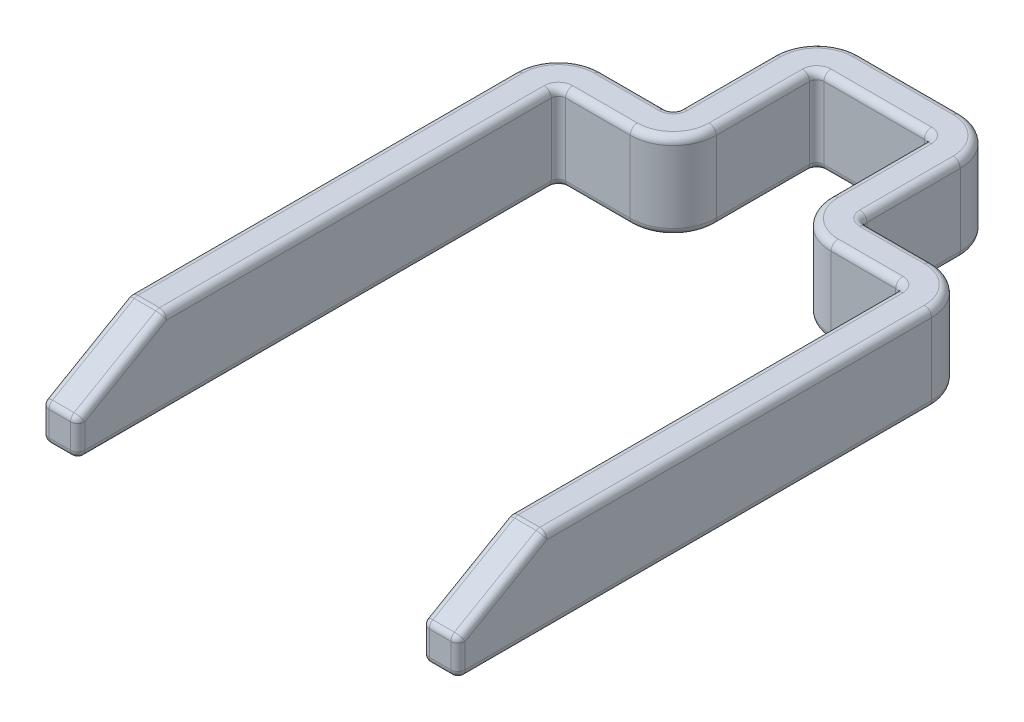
ISO-10303-21;
HEADER;
FILE_DESCRIPTION(('STEP AP214'),'2;1');
FILE_NAME('part.step','',(''),(''),'','','');
FILE_SCHEMA(('AUTOMOTIVE_DESIGN { 1 0 10303 214 1 1 1 1 }'));
ENDSEC;
DATA;
#1=APPLICATION_CONTEXT('core data for automotive mechanical design processes');
#2=APPLICATION_PROTOCOL_DEFINITION('international standard','automotive_design',2000,#1);
#3=PRODUCT_CONTEXT('',#1,'mechanical');
#4=PRODUCT('Part','Part','',(#3));
#5=PRODUCT_RELATED_PRODUCT_CATEGORY('part','',(#4));
#6=PRODUCT_DEFINITION_FORMATION('','',#4);
#7=PRODUCT_DEFINITION_CONTEXT('part definition',#1,'design');
#8=PRODUCT_DEFINITION('design','',#6,#7);
#9=PRODUCT_DEFINITION_SHAPE('','',#8);
#10=(LENGTH_UNIT() NAMED_UNIT(*) SI_UNIT(.MILLI.,.METRE.));
#11=(NAMED_UNIT(*) PLANE_ANGLE_UNIT() SI_UNIT($,.RADIAN.));
#12=(NAMED_UNIT(*) SI_UNIT($,.STERADIAN.) SOLID_ANGLE_UNIT());
#13=UNCERTAINTY_MEASURE_WITH_UNIT(LENGTH_MEASURE(1.E-05),#10,'distance_accuracy_value','');
#14=(GEOMETRIC_REPRESENTATION_CONTEXT(3) GLOBAL_UNCERTAINTY_ASSIGNED_CONTEXT((#13)) GLOBAL_UNIT_ASSIGNED_CONTEXT((#10,
#11,#12)) REPRESENTATION_CONTEXT('',''));
#15=CARTESIAN_POINT('',(0.,0.,0.));
#16=DIRECTION('',(0.,0.,1.));
#17=DIRECTION('',(1.,0.,0.));
#18=AXIS2_PLACEMENT_3D('',#15,#16,#17);
#19=CARTESIAN_POINT('',(12.,3.,-9.5));
#20=DIRECTION('',(1.,0.,0.));
#21=DIRECTION('',(0.,0.,-1.));
#22=AXIS2_PLACEMENT_3D('',#19,#20,#21);
#23=PLANE('',#22);
#24=DIRECTION('',(0.,0.499999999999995,-0.866025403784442));
#25=VECTOR('',#24,1.);
#26=CARTESIAN_POINT('',(12.,14.2314064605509,-3.01554445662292));
#27=LINE('',#26,#25);
#28=CARTESIAN_POINT('',(12.,-0.788675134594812,23.));
#29=VERTEX_POINT('',#28);
#30=CARTESIAN_POINT('',(12.,2.5,17.3038475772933));
#31=VERTEX_POINT('',#30);
#32=EDGE_CURVE('E567',#29,#31,#27,.T.);
#33=ORIENTED_EDGE('',*,*,#32,.T.);
#34=DIRECTION('',(0.,0.,1.));
#35=VECTOR('',#34,1.);
#36=CARTESIAN_POINT('',(12.,2.5,-9.5));
#37=LINE('',#36,#35);
#38=CARTESIAN_POINT('',(12.,2.5,-9.5));
#39=VERTEX_POINT('',#38);
#40=EDGE_CURVE('E571',#31,#39,#37,.F.);
#41=ORIENTED_EDGE('',*,*,#40,.T.);
#42=DIRECTION('',(0.,-1.,0.));
#43=VECTOR('',#42,1.);
#44=CARTESIAN_POINT('',(12.,3.,-9.5));
#45=LINE('',#44,#43);
#46=CARTESIAN_POINT('',(12.,-2.5,-9.5));
#47=VERTEX_POINT('',#46);
#48=EDGE_CURVE('E822',#39,#47,#45,.T.);
#49=ORIENTED_EDGE('',*,*,#48,.T.);
#50=DIRECTION('',(0.,0.,1.));
#51=VECTOR('',#50,1.);
#52=CARTESIAN_POINT('',(12.,-2.5,-9.5));
#53=LINE('',#52,#51);
#54=CARTESIAN_POINT('',(12.,-2.5,23.));
#55=VERTEX_POINT('',#54);
#56=EDGE_CURVE('E569',#47,#55,#53,.T.);
#57=ORIENTED_EDGE('',*,*,#56,.T.);
#58=DIRECTION('',(0.,-1.,0.));
#59=VECTOR('',#58,1.);
#60=CARTESIAN_POINT('',(12.,-0.5,23.));
#61=LINE('',#60,#59);
#62=EDGE_CURVE('E565',#55,#29,#61,.F.);
#63=ORIENTED_EDGE('',*,*,#62,.T.);
#64=EDGE_LOOP('',(#33,#41,#49,#57,#63));
#65=FACE_BOUND('',#64,.T.);
#66=ADVANCED_FACE('F28',(#65),#23,.F.);
#67=CARTESIAN_POINT('',(14.5,3.,23.5));
#68=DIRECTION('',(0.,0.,1.));
#69=DIRECTION('',(1.,0.,0.));
#70=AXIS2_PLACEMENT_3D('',#67,#68,#69);
#71=PLANE('',#70);
#72=DIRECTION('',(-1.,0.,0.));
#73=VECTOR('',#72,1.);
#74=CARTESIAN_POINT('',(14.5,-2.5,23.5));
#75=LINE('',#74,#73);
#76=CARTESIAN_POINT('',(12.5,-2.5,23.5));
#77=VERTEX_POINT('',#76);
#78=CARTESIAN_POINT('',(14.,-2.5,23.5));
#79=VERTEX_POINT('',#78);
#80=EDGE_CURVE('E35',#77,#79,#75,.F.);
#81=ORIENTED_EDGE('',*,*,#80,.T.);
#82=DIRECTION('',(0.,-1.,0.));
#83=VECTOR('',#82,1.);
#84=CARTESIAN_POINT('',(14.,3.,23.5));
#85=LINE('',#84,#83);
#86=CARTESIAN_POINT('',(14.,-0.788675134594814,23.5));
#87=VERTEX_POINT('',#86);
#88=EDGE_CURVE('E11',#79,#87,#85,.F.);
#89=ORIENTED_EDGE('',*,*,#88,.T.);
#90=DIRECTION('',(1.,0.,0.));
#91=VECTOR('',#90,1.);
#92=CARTESIAN_POINT('',(12.,-0.788675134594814,23.5));
#93=LINE('',#92,#91);
#94=CARTESIAN_POINT('',(12.5,-0.788675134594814,23.5));
#95=VERTEX_POINT('',#94);
#96=EDGE_CURVE('E731',#87,#95,#93,.F.);
#97=ORIENTED_EDGE('',*,*,#96,.T.);
#98=DIRECTION('',(0.,-1.,0.));
#99=VECTOR('',#98,1.);
#100=CARTESIAN_POINT('',(12.5,-3.,23.5));
#101=LINE('',#100,#99);
#102=EDGE_CURVE('E45',#95,#77,#101,.T.);
#103=ORIENTED_EDGE('',*,*,#102,.T.);
#104=EDGE_LOOP('',(#81,#89,#97,#103));
#105=FACE_BOUND('',#104,.T.);
#106=ADVANCED_FACE('F734',(#105),#71,.T.);
#107=CARTESIAN_POINT('',(14.5,3.,-9.5));
#108=DIRECTION('',(1.,0.,0.));
#109=DIRECTION('',(0.,0.,-1.));
#110=AXIS2_PLACEMENT_3D('',#107,#108,#109);
#111=PLANE('',#110);
#112=DIRECTION('',(0.,-1.,0.));
#113=VECTOR('',#112,1.);
#114=CARTESIAN_POINT('',(14.5,3.,-9.5));
#115=LINE('',#114,#113);
#116=CARTESIAN_POINT('',(14.5,2.5,-9.5));
#117=VERTEX_POINT('',#116);
#118=CARTESIAN_POINT('',(14.5,-2.5,-9.5));
#119=VERTEX_POINT('',#118);
#120=EDGE_CURVE('E885',#117,#119,#115,.T.);
#121=ORIENTED_EDGE('',*,*,#120,.F.);
#122=DIRECTION('',(0.,0.,1.));
#123=VECTOR('',#122,1.);
#124=CARTESIAN_POINT('',(14.5,2.5,-9.5));
#125=LINE('',#124,#123);
#126=CARTESIAN_POINT('',(14.5,2.5,17.3038475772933));
#127=VERTEX_POINT('',#126);
#128=EDGE_CURVE('E663',#117,#127,#125,.T.);
#129=ORIENTED_EDGE('',*,*,#128,.T.);
#130=DIRECTION('',(0.,0.499999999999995,-0.866025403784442));
#131=VECTOR('',#130,1.);
#132=CARTESIAN_POINT('',(14.5,-0.93301270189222,23.25));
#133=LINE('',#132,#131);
#134=CARTESIAN_POINT('',(14.5,-0.788675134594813,23.));
#135=VERTEX_POINT('',#134);
#136=EDGE_CURVE('E659',#127,#135,#133,.F.);
#137=ORIENTED_EDGE('',*,*,#136,.T.);
#138=DIRECTION('',(0.,-1.,0.));
#139=VECTOR('',#138,1.);
#140=CARTESIAN_POINT('',(14.5,3.,23.));
#141=LINE('',#140,#139);
#142=CARTESIAN_POINT('',(14.5,-2.5,23.));
#143=VERTEX_POINT('',#142);
#144=EDGE_CURVE('E657',#135,#143,#141,.T.);
#145=ORIENTED_EDGE('',*,*,#144,.T.);
#146=DIRECTION('',(0.,0.,1.));
#147=VECTOR('',#146,1.);
#148=CARTESIAN_POINT('',(14.5,-2.5,-9.5));
#149=LINE('',#148,#147);
#150=EDGE_CURVE('E661',#143,#119,#149,.F.);
#151=ORIENTED_EDGE('',*,*,#150,.T.);
#152=EDGE_LOOP('',(#121,#129,#137,#145,#151));
#153=FACE_BOUND('',#152,.T.);
#154=ADVANCED_FACE('F1108',(#153),#111,.T.);
#155=CARTESIAN_POINT('',(11.5,3.,-9.5));
#156=DIRECTION('',(0.,-1.,0.));
#157=DIRECTION('',(0.,0.,-1.));
#158=AXIS2_PLACEMENT_3D('',#155,#156,#157);
#159=CYLINDRICAL_SURFACE('',#158,3.);
#160=DIRECTION('',(0.,-1.,0.));
#161=VECTOR('',#160,1.);
#162=CARTESIAN_POINT('',(11.5,3.,-12.5));
#163=LINE('',#162,#161);
#164=CARTESIAN_POINT('',(11.5,2.5,-12.5));
#165=VERTEX_POINT('',#164);
#166=CARTESIAN_POINT('',(11.5,-2.5,-12.5));
#167=VERTEX_POINT('',#166);
#168=EDGE_CURVE('E882',#165,#167,#163,.T.);
#169=ORIENTED_EDGE('',*,*,#168,.F.);
#170=CARTESIAN_POINT('',(11.5,2.5,-9.5));
#171=DIRECTION('',(0.,1.,0.));
#172=DIRECTION('',(0.,0.,1.));
#173=AXIS2_PLACEMENT_3D('',#170,#171,#172);
#174=CIRCLE('',#173,3.);
#175=EDGE_CURVE('E655',#165,#117,#174,.F.);
#176=ORIENTED_EDGE('',*,*,#175,.T.);
#177=ORIENTED_EDGE('',*,*,#120,.T.);
#178=CARTESIAN_POINT('',(11.5,-2.5,-9.5));
#179=DIRECTION('',(0.,1.,0.));
#180=DIRECTION('',(0.,0.,1.));
#181=AXIS2_PLACEMENT_3D('',#178,#179,#180);
#182=CIRCLE('',#181,3.);
#183=EDGE_CURVE('E653',#119,#167,#182,.T.);
#184=ORIENTED_EDGE('',*,*,#183,.T.);
#185=EDGE_LOOP('',(#169,#176,#177,#184));
#186=FACE_BOUND('',#185,.T.);
#187=ADVANCED_FACE('F1104',(#186),#159,.T.);
#188=CARTESIAN_POINT('',(7.00000000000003,3.,-12.5));
#189=DIRECTION('',(0.,0.,-1.));
#190=DIRECTION('',(-1.,0.,0.));
#191=AXIS2_PLACEMENT_3D('',#188,#189,#190);
#192=PLANE('',#191);
#193=DIRECTION('',(0.,-1.,0.));
#194=VECTOR('',#193,1.);
#195=CARTESIAN_POINT('',(7.00000000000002,3.,-12.5));
#196=LINE('',#195,#194);
#197=CARTESIAN_POINT('',(7.00000000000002,2.5,-12.5));
#198=VERTEX_POINT('',#197);
#199=CARTESIAN_POINT('',(7.00000000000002,-2.5,-12.5));
#200=VERTEX_POINT('',#199);
#201=EDGE_CURVE('E879',#198,#200,#196,.T.);
#202=ORIENTED_EDGE('',*,*,#201,.F.);
#203=DIRECTION('',(1.,0.,0.));
#204=VECTOR('',#203,1.);
#205=CARTESIAN_POINT('',(7.00000000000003,2.5,-12.5));
#206=LINE('',#205,#204);
#207=EDGE_CURVE('E651',#198,#165,#206,.T.);
#208=ORIENTED_EDGE('',*,*,#207,.T.);
#209=ORIENTED_EDGE('',*,*,#168,.T.);
#210=DIRECTION('',(1.,0.,0.));
#211=VECTOR('',#210,1.);
#212=CARTESIAN_POINT('',(7.00000000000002,-2.5,-12.5));
#213=LINE('',#212,#211);
#214=EDGE_CURVE('E649',#167,#200,#213,.F.);
#215=ORIENTED_EDGE('',*,*,#214,.T.);
#216=EDGE_LOOP('',(#202,#208,#209,#215));
#217=FACE_BOUND('',#216,.T.);
#218=ADVANCED_FACE('F1090',(#217),#192,.T.);
#219=CARTESIAN_POINT('',(7.,3.,-13.));
#220=DIRECTION('',(0.,-1.,0.));
#221=DIRECTION('',(0.,0.,-1.));
#222=AXIS2_PLACEMENT_3D('',#219,#220,#221);
#223=CYLINDRICAL_SURFACE('',#222,0.5);
#224=DIRECTION('',(0.,-1.,0.));
#225=VECTOR('',#224,1.);
#226=CARTESIAN_POINT('',(6.5,3.,-13.));
#227=LINE('',#226,#225);
#228=CARTESIAN_POINT('',(6.5,2.5,-13.));
#229=VERTEX_POINT('',#228);
#230=CARTESIAN_POINT('',(6.5,-2.5,-13.));
#231=VERTEX_POINT('',#230);
#232=EDGE_CURVE('E876',#229,#231,#227,.T.);
#233=ORIENTED_EDGE('',*,*,#232,.F.);
#234=CARTESIAN_POINT('',(7.,2.5,-13.));
#235=DIRECTION('',(0.,1.,0.));
#236=DIRECTION('',(0.,0.,1.));
#237=AXIS2_PLACEMENT_3D('',#234,#235,#236);
#238=CIRCLE('',#237,0.5);
#239=EDGE_CURVE('E647',#229,#198,#238,.T.);
#240=ORIENTED_EDGE('',*,*,#239,.T.);
#241=ORIENTED_EDGE('',*,*,#201,.T.);
#242=CARTESIAN_POINT('',(7.,-2.5,-13.));
#243=DIRECTION('',(0.,1.,0.));
#244=DIRECTION('',(0.,0.,1.));
#245=AXIS2_PLACEMENT_3D('',#242,#243,#244);
#246=CIRCLE('',#245,0.5);
#247=EDGE_CURVE('E645',#200,#231,#246,.F.);
#248=ORIENTED_EDGE('',*,*,#247,.T.);
#249=EDGE_LOOP('',(#233,#240,#241,#248));
#250=FACE_BOUND('',#249,.T.);
#251=ADVANCED_FACE('F1086',(#250),#223,.F.);
#252=CARTESIAN_POINT('',(6.5,3.,-19.5));
#253=DIRECTION('',(1.,0.,0.));
#254=DIRECTION('',(0.,0.,-1.));
#255=AXIS2_PLACEMENT_3D('',#252,#253,#254);
#256=PLANE('',#255);
#257=DIRECTION('',(0.,-1.,0.));
#258=VECTOR('',#257,1.);
#259=CARTESIAN_POINT('',(6.5,3.,-19.5));
#260=LINE('',#259,#258);
#261=CARTESIAN_POINT('',(6.5,2.5,-19.5));
#262=VERTEX_POINT('',#261);
#263=CARTESIAN_POINT('',(6.5,-2.5,-19.5));
#264=VERTEX_POINT('',#263);
#265=EDGE_CURVE('E873',#262,#264,#260,.T.);
#266=ORIENTED_EDGE('',*,*,#265,.F.);
#267=DIRECTION('',(0.,0.,1.));
#268=VECTOR('',#267,1.);
#269=CARTESIAN_POINT('',(6.5,2.5,-19.5));
#270=LINE('',#269,#268);
#271=EDGE_CURVE('E643',#262,#229,#270,.T.);
#272=ORIENTED_EDGE('',*,*,#271,.T.);
#273=ORIENTED_EDGE('',*,*,#232,.T.);
#274=DIRECTION('',(0.,0.,1.));
#275=VECTOR('',#274,1.);
#276=CARTESIAN_POINT('',(6.5,-2.5,-19.5));
#277=LINE('',#276,#275);
#278=EDGE_CURVE('E641',#231,#264,#277,.F.);
#279=ORIENTED_EDGE('',*,*,#278,.T.);
#280=EDGE_LOOP('',(#266,#272,#273,#279));
#281=FACE_BOUND('',#280,.T.);
#282=ADVANCED_FACE('F1152',(#281),#256,.T.);
#283=CARTESIAN_POINT('',(3.5,3.,-19.5));
#284=DIRECTION('',(0.,-1.,0.));
#285=DIRECTION('',(0.,0.,-1.));
#286=AXIS2_PLACEMENT_3D('',#283,#284,#285);
#287=CYLINDRICAL_SURFACE('',#286,3.);
#288=DIRECTION('',(0.,-1.,0.));
#289=VECTOR('',#288,1.);
#290=CARTESIAN_POINT('',(3.49999999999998,3.,-22.5));
#291=LINE('',#290,#289);
#292=CARTESIAN_POINT('',(3.49999999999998,2.5,-22.5));
#293=VERTEX_POINT('',#292);
#294=CARTESIAN_POINT('',(3.49999999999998,-2.5,-22.5));
#295=VERTEX_POINT('',#294);
#296=EDGE_CURVE('E870',#293,#295,#291,.T.);
#297=ORIENTED_EDGE('',*,*,#296,.F.);
#298=CARTESIAN_POINT('',(3.5,2.5,-19.5));
#299=DIRECTION('',(0.,1.,0.));
#300=DIRECTION('',(0.,0.,1.));
#301=AXIS2_PLACEMENT_3D('',#298,#299,#300);
#302=CIRCLE('',#301,3.);
#303=EDGE_CURVE('E639',#293,#262,#302,.F.);
#304=ORIENTED_EDGE('',*,*,#303,.T.);
#305=ORIENTED_EDGE('',*,*,#265,.T.);
#306=CARTESIAN_POINT('',(3.5,-2.5,-19.5));
#307=DIRECTION('',(0.,1.,0.));
#308=DIRECTION('',(0.,0.,1.));
#309=AXIS2_PLACEMENT_3D('',#306,#307,#308);
#310=CIRCLE('',#309,3.);
#311=EDGE_CURVE('E637',#264,#295,#310,.T.);
#312=ORIENTED_EDGE('',*,*,#311,.T.);
#313=EDGE_LOOP('',(#297,#304,#305,#312));
#314=FACE_BOUND('',#313,.T.);
#315=ADVANCED_FACE('F1156',(#314),#287,.T.);
#316=CARTESIAN_POINT('',(-3.49999999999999,3.,-22.5));
#317=DIRECTION('',(0.,0.,-1.));
#318=DIRECTION('',(-1.,0.,0.));
#319=AXIS2_PLACEMENT_3D('',#316,#317,#318);
#320=PLANE('',#319);
#321=DIRECTION('',(0.,-1.,0.));
#322=VECTOR('',#321,1.);
#323=CARTESIAN_POINT('',(-3.49999999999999,3.,-22.5));
#324=LINE('',#323,#322);
#325=CARTESIAN_POINT('',(-3.49999999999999,2.5,-22.5));
#326=VERTEX_POINT('',#325);
#327=CARTESIAN_POINT('',(-3.49999999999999,-2.5,-22.5));
#328=VERTEX_POINT('',#327);
#329=EDGE_CURVE('E867',#326,#328,#324,.T.);
#330=ORIENTED_EDGE('',*,*,#329,.F.);
#331=DIRECTION('',(1.,0.,0.));
#332=VECTOR('',#331,1.);
#333=CARTESIAN_POINT('',(-3.49999999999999,2.5,-22.5));
#334=LINE('',#333,#332);
#335=EDGE_CURVE('E635',#326,#293,#334,.T.);
#336=ORIENTED_EDGE('',*,*,#335,.T.);
#337=ORIENTED_EDGE('',*,*,#296,.T.);
#338=DIRECTION('',(1.,0.,0.));
#339=VECTOR('',#338,1.);
#340=CARTESIAN_POINT('',(-3.49999999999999,-2.5,-22.5));
#341=LINE('',#340,#339);
#342=EDGE_CURVE('E633',#295,#328,#341,.F.);
#343=ORIENTED_EDGE('',*,*,#342,.T.);
#344=EDGE_LOOP('',(#330,#336,#337,#343));
#345=FACE_BOUND('',#344,.T.);
#346=ADVANCED_FACE('F1174',(#345),#320,.T.);
#347=CARTESIAN_POINT('',(-3.49999999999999,3.,-19.5));
#348=DIRECTION('',(0.,-1.,0.));
#349=DIRECTION('',(0.,0.,-1.));
#350=AXIS2_PLACEMENT_3D('',#347,#348,#349);
#351=CYLINDRICAL_SURFACE('',#350,3.);
#352=DIRECTION('',(0.,-1.,0.));
#353=VECTOR('',#352,1.);
#354=CARTESIAN_POINT('',(-6.49999999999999,3.,-19.5));
#355=LINE('',#354,#353);
#356=CARTESIAN_POINT('',(-6.49999999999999,2.5,-19.5));
#357=VERTEX_POINT('',#356);
#358=CARTESIAN_POINT('',(-6.49999999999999,-2.5,-19.5));
#359=VERTEX_POINT('',#358);
#360=EDGE_CURVE('E864',#357,#359,#355,.T.);
#361=ORIENTED_EDGE('',*,*,#360,.F.);
#362=CARTESIAN_POINT('',(-3.49999999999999,2.5,-19.5));
#363=DIRECTION('',(0.,1.,0.));
#364=DIRECTION('',(0.,0.,1.));
#365=AXIS2_PLACEMENT_3D('',#362,#363,#364);
#366=CIRCLE('',#365,3.);
#367=EDGE_CURVE('E631',#357,#326,#366,.F.);
#368=ORIENTED_EDGE('',*,*,#367,.T.);
#369=ORIENTED_EDGE('',*,*,#329,.T.);
#370=CARTESIAN_POINT('',(-3.49999999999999,-2.5,-19.5));
#371=DIRECTION('',(0.,1.,0.));
#372=DIRECTION('',(0.,0.,1.));
#373=AXIS2_PLACEMENT_3D('',#370,#371,#372);
#374=CIRCLE('',#373,3.);
#375=EDGE_CURVE('E629',#328,#359,#374,.T.);
#376=ORIENTED_EDGE('',*,*,#375,.T.);
#377=EDGE_LOOP('',(#361,#368,#369,#376));
#378=FACE_BOUND('',#377,.T.);
#379=ADVANCED_FACE('F1178',(#378),#351,.T.);
#380=CARTESIAN_POINT('',(-6.49999999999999,3.,-13.));
#381=DIRECTION('',(-1.,0.,0.));
#382=DIRECTION('',(0.,0.,1.));
#383=AXIS2_PLACEMENT_3D('',#380,#381,#382);
#384=PLANE('',#383);
#385=DIRECTION('',(0.,-1.,0.));
#386=VECTOR('',#385,1.);
#387=CARTESIAN_POINT('',(-6.49999999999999,3.,-13.));
#388=LINE('',#387,#386);
#389=CARTESIAN_POINT('',(-6.49999999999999,2.5,-13.));
#390=VERTEX_POINT('',#389);
#391=CARTESIAN_POINT('',(-6.49999999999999,-2.5,-13.));
#392=VERTEX_POINT('',#391);
#393=EDGE_CURVE('E861',#390,#392,#388,.T.);
#394=ORIENTED_EDGE('',*,*,#393,.F.);
#395=DIRECTION('',(0.,0.,-1.));
#396=VECTOR('',#395,1.);
#397=CARTESIAN_POINT('',(-6.49999999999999,2.5,-13.));
#398=LINE('',#397,#396);
#399=EDGE_CURVE('E627',#390,#357,#398,.T.);
#400=ORIENTED_EDGE('',*,*,#399,.T.);
#401=ORIENTED_EDGE('',*,*,#360,.T.);
#402=DIRECTION('',(0.,0.,-1.));
#403=VECTOR('',#402,1.);
#404=CARTESIAN_POINT('',(-6.49999999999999,-2.5,-13.));
#405=LINE('',#404,#403);
#406=EDGE_CURVE('E625',#359,#392,#405,.F.);
#407=ORIENTED_EDGE('',*,*,#406,.T.);
#408=EDGE_LOOP('',(#394,#400,#401,#407));
#409=FACE_BOUND('',#408,.T.);
#410=ADVANCED_FACE('F1393',(#409),#384,.T.);
#411=CARTESIAN_POINT('',(-6.99999999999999,3.,-13.));
#412=DIRECTION('',(0.,-1.,0.));
#413=DIRECTION('',(0.,0.,-1.));
#414=AXIS2_PLACEMENT_3D('',#411,#412,#413);
#415=CYLINDRICAL_SURFACE('',#414,0.5);
#416=DIRECTION('',(0.,-1.,0.));
#417=VECTOR('',#416,1.);
#418=CARTESIAN_POINT('',(-7.,3.,-12.5));
#419=LINE('',#418,#417);
#420=CARTESIAN_POINT('',(-7.,2.5,-12.5));
#421=VERTEX_POINT('',#420);
#422=CARTESIAN_POINT('',(-7.,-2.5,-12.5));
#423=VERTEX_POINT('',#422);
#424=EDGE_CURVE('E858',#421,#423,#419,.T.);
#425=ORIENTED_EDGE('',*,*,#424,.F.);
#426=CARTESIAN_POINT('',(-6.99999999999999,2.5,-13.));
#427=DIRECTION('',(0.,1.,0.));
#428=DIRECTION('',(0.,0.,1.));
#429=AXIS2_PLACEMENT_3D('',#426,#427,#428);
#430=CIRCLE('',#429,0.5);
#431=EDGE_CURVE('E623',#421,#390,#430,.T.);
#432=ORIENTED_EDGE('',*,*,#431,.T.);
#433=ORIENTED_EDGE('',*,*,#393,.T.);
#434=CARTESIAN_POINT('',(-6.99999999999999,-2.5,-13.));
#435=DIRECTION('',(0.,1.,0.));
#436=DIRECTION('',(0.,0.,1.));
#437=AXIS2_PLACEMENT_3D('',#434,#435,#436);
#438=CIRCLE('',#437,0.5);
#439=EDGE_CURVE('E621',#392,#423,#438,.F.);
#440=ORIENTED_EDGE('',*,*,#439,.T.);
#441=EDGE_LOOP('',(#425,#432,#433,#440));
#442=FACE_BOUND('',#441,.T.);
#443=ADVANCED_FACE('F1389',(#442),#415,.F.);
#444=CARTESIAN_POINT('',(-11.5,3.,-12.5));
#445=DIRECTION('',(0.,0.,-1.));
#446=DIRECTION('',(-1.,0.,0.));
#447=AXIS2_PLACEMENT_3D('',#444,#445,#446);
#448=PLANE('',#447);
#449=DIRECTION('',(0.,-1.,0.));
#450=VECTOR('',#449,1.);
#451=CARTESIAN_POINT('',(-11.5,3.,-12.5));
#452=LINE('',#451,#450);
#453=CARTESIAN_POINT('',(-11.5,2.5,-12.5));
#454=VERTEX_POINT('',#453);
#455=CARTESIAN_POINT('',(-11.5,-2.5,-12.5));
#456=VERTEX_POINT('',#455);
#457=EDGE_CURVE('E855',#454,#456,#452,.T.);
#458=ORIENTED_EDGE('',*,*,#457,.F.);
#459=DIRECTION('',(1.,0.,0.));
#460=VECTOR('',#459,1.);
#461=CARTESIAN_POINT('',(-11.5,2.5,-12.5));
#462=LINE('',#461,#460);
#463=EDGE_CURVE('E619',#454,#421,#462,.T.);
#464=ORIENTED_EDGE('',*,*,#463,.T.);
#465=ORIENTED_EDGE('',*,*,#424,.T.);
#466=DIRECTION('',(1.,0.,0.));
#467=VECTOR('',#466,1.);
#468=CARTESIAN_POINT('',(-11.5,-2.5,-12.5));
#469=LINE('',#468,#467);
#470=EDGE_CURVE('E617',#423,#456,#469,.F.);
#471=ORIENTED_EDGE('',*,*,#470,.T.);
#472=EDGE_LOOP('',(#458,#464,#465,#471));
#473=FACE_BOUND('',#472,.T.);
#474=ADVANCED_FACE('F1385',(#473),#448,.T.);
#475=CARTESIAN_POINT('',(-11.5,3.,-9.5));
#476=DIRECTION('',(0.,-1.,0.));
#477=DIRECTION('',(0.,0.,-1.));
#478=AXIS2_PLACEMENT_3D('',#475,#476,#477);
#479=CYLINDRICAL_SURFACE('',#478,3.);
#480=DIRECTION('',(0.,-1.,0.));
#481=VECTOR('',#480,1.);
#482=CARTESIAN_POINT('',(-14.5,3.,-9.49999999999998));
#483=LINE('',#482,#481);
#484=CARTESIAN_POINT('',(-14.5,2.5,-9.49999999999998));
#485=VERTEX_POINT('',#484);
#486=CARTESIAN_POINT('',(-14.5,-2.5,-9.49999999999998));
#487=VERTEX_POINT('',#486);
#488=EDGE_CURVE('E460',#485,#487,#483,.T.);
#489=ORIENTED_EDGE('',*,*,#488,.F.);
#490=CARTESIAN_POINT('',(-11.5,2.5,-9.5));
#491=DIRECTION('',(0.,1.,0.));
#492=DIRECTION('',(0.,0.,1.));
#493=AXIS2_PLACEMENT_3D('',#490,#491,#492);
#494=CIRCLE('',#493,3.);
#495=EDGE_CURVE('E615',#485,#454,#494,.F.);
#496=ORIENTED_EDGE('',*,*,#495,.T.);
#497=ORIENTED_EDGE('',*,*,#457,.T.);
#498=CARTESIAN_POINT('',(-11.5,-2.5,-9.5));
#499=DIRECTION('',(0.,1.,0.));
#500=DIRECTION('',(0.,0.,1.));
#501=AXIS2_PLACEMENT_3D('',#498,#499,#500);
#502=CIRCLE('',#501,3.);
#503=EDGE_CURVE('E449',#456,#487,#502,.T.);
#504=ORIENTED_EDGE('',*,*,#503,.T.);
#505=EDGE_LOOP('',(#489,#496,#497,#504));
#506=FACE_BOUND('',#505,.T.);
#507=ADVANCED_FACE('F1381',(#506),#479,.T.);
#508=CARTESIAN_POINT('',(-14.5,3.,23.5));
#509=DIRECTION('',(-1.,0.,0.));
#510=DIRECTION('',(0.,0.,1.));
#511=AXIS2_PLACEMENT_3D('',#508,#509,#510);
#512=PLANE('',#511);
#513=DIRECTION('',(0.,0.499999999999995,-0.866025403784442));
#514=VECTOR('',#513,1.);
#515=CARTESIAN_POINT('',(-14.5,2.56698729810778,17.1878221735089));
#516=LINE('',#515,#514);
#517=CARTESIAN_POINT('',(-14.5,-0.788675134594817,23.));
#518=VERTEX_POINT('',#517);
#519=CARTESIAN_POINT('',(-14.5,2.5,17.3038475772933));
#520=VERTEX_POINT('',#519);
#521=EDGE_CURVE('E496',#518,#520,#516,.T.);
#522=ORIENTED_EDGE('',*,*,#521,.T.);
#523=DIRECTION('',(0.,0.,-1.));
#524=VECTOR('',#523,1.);
#525=CARTESIAN_POINT('',(-14.5,2.5,23.5));
#526=LINE('',#525,#524);
#527=EDGE_CURVE('E498',#520,#485,#526,.T.);
#528=ORIENTED_EDGE('',*,*,#527,.T.);
#529=ORIENTED_EDGE('',*,*,#488,.T.);
#530=DIRECTION('',(0.,0.,-1.));
#531=VECTOR('',#530,1.);
#532=CARTESIAN_POINT('',(-14.5,-2.5,23.5));
#533=LINE('',#532,#531);
#534=CARTESIAN_POINT('',(-14.5,-2.5,23.));
#535=VERTEX_POINT('',#534);
#536=EDGE_CURVE('E491',#487,#535,#533,.F.);
#537=ORIENTED_EDGE('',*,*,#536,.T.);
#538=DIRECTION('',(0.,-1.,0.));
#539=VECTOR('',#538,1.);
#540=CARTESIAN_POINT('',(-14.5,3.,23.));
#541=LINE('',#540,#539);
#542=EDGE_CURVE('E493',#535,#518,#541,.F.);
#543=ORIENTED_EDGE('',*,*,#542,.T.);
#544=EDGE_LOOP('',(#522,#528,#529,#537,#543));
#545=FACE_BOUND('',#544,.T.);
#546=ADVANCED_FACE('F1377',(#545),#512,.T.);
#547=CARTESIAN_POINT('',(-12.,3.,23.5));
#548=DIRECTION('',(0.,0.,1.));
#549=DIRECTION('',(1.,0.,0.));
#550=AXIS2_PLACEMENT_3D('',#547,#548,#549);
#551=PLANE('',#550);
#552=DIRECTION('',(0.,-1.,0.));
#553=VECTOR('',#552,1.);
#554=CARTESIAN_POINT('',(-12.5,-0.5,23.5));
#555=LINE('',#554,#553);
#556=CARTESIAN_POINT('',(-12.5,-2.5,23.5));
#557=VERTEX_POINT('',#556);
#558=CARTESIAN_POINT('',(-12.5,-0.788675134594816,23.5));
#559=VERTEX_POINT('',#558);
#560=EDGE_CURVE('E486',#557,#559,#555,.F.);
#561=ORIENTED_EDGE('',*,*,#560,.T.);
#562=DIRECTION('',(1.,0.,0.));
#563=VECTOR('',#562,1.);
#564=CARTESIAN_POINT('',(-14.5,-0.788675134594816,23.5));
#565=LINE('',#564,#563);
#566=CARTESIAN_POINT('',(-14.,-0.788675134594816,23.5));
#567=VERTEX_POINT('',#566);
#568=EDGE_CURVE('E489',#559,#567,#565,.F.);
#569=ORIENTED_EDGE('',*,*,#568,.T.);
#570=DIRECTION('',(0.,-1.,0.));
#571=VECTOR('',#570,1.);
#572=CARTESIAN_POINT('',(-14.,3.,23.5));
#573=LINE('',#572,#571);
#574=CARTESIAN_POINT('',(-14.,-2.5,23.5));
#575=VERTEX_POINT('',#574);
#576=EDGE_CURVE('E479',#567,#575,#573,.T.);
#577=ORIENTED_EDGE('',*,*,#576,.T.);
#578=DIRECTION('',(-1.,0.,0.));
#579=VECTOR('',#578,1.);
#580=CARTESIAN_POINT('',(-12.,-2.5,23.5));
#581=LINE('',#580,#579);
#582=EDGE_CURVE('E476',#575,#557,#581,.F.);
#583=ORIENTED_EDGE('',*,*,#582,.T.);
#584=EDGE_LOOP('',(#561,#569,#577,#583));
#585=FACE_BOUND('',#584,.T.);
#586=ADVANCED_FACE('F1374',(#585),#551,.T.);
#587=CARTESIAN_POINT('',(-12.,3.,23.5));
#588=DIRECTION('',(-1.,0.,0.));
#589=DIRECTION('',(0.,0.,1.));
#590=AXIS2_PLACEMENT_3D('',#587,#588,#589);
#591=PLANE('',#590);
#592=DIRECTION('',(0.,-1.,0.));
#593=VECTOR('',#592,1.);
#594=CARTESIAN_POINT('',(-12.,3.,-9.5));
#595=LINE('',#594,#593);
#596=CARTESIAN_POINT('',(-12.,2.5,-9.5));
#597=VERTEX_POINT('',#596);
#598=CARTESIAN_POINT('',(-12.,-2.5,-9.5));
#599=VERTEX_POINT('',#598);
#600=EDGE_CURVE('E441',#597,#599,#595,.T.);
#601=ORIENTED_EDGE('',*,*,#600,.F.);
#602=DIRECTION('',(0.,0.,-1.));
#603=VECTOR('',#602,1.);
#604=CARTESIAN_POINT('',(-12.,2.5,17.4378221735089));
#605=LINE('',#604,#603);
#606=CARTESIAN_POINT('',(-12.,2.5,17.3038475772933));
#607=VERTEX_POINT('',#606);
#608=EDGE_CURVE('E455',#597,#607,#605,.F.);
#609=ORIENTED_EDGE('',*,*,#608,.T.);
#610=DIRECTION('',(0.,-0.499999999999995,0.866025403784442));
#611=VECTOR('',#610,1.);
#612=CARTESIAN_POINT('',(-12.,-0.0580127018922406,21.7344555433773));
#613=LINE('',#612,#611);
#614=CARTESIAN_POINT('',(-12.,-0.788675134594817,23.));
#615=VERTEX_POINT('',#614);
#616=EDGE_CURVE('E477',#607,#615,#613,.T.);
#617=ORIENTED_EDGE('',*,*,#616,.T.);
#618=DIRECTION('',(0.,-1.,0.));
#619=VECTOR('',#618,1.);
#620=CARTESIAN_POINT('',(-12.,-3.,23.));
#621=LINE('',#620,#619);
#622=CARTESIAN_POINT('',(-12.,-2.5,23.));
#623=VERTEX_POINT('',#622);
#624=EDGE_CURVE('E481',#615,#623,#621,.T.);
#625=ORIENTED_EDGE('',*,*,#624,.T.);
#626=DIRECTION('',(0.,0.,-1.));
#627=VECTOR('',#626,1.);
#628=CARTESIAN_POINT('',(-12.,-2.5,23.5));
#629=LINE('',#628,#627);
#630=EDGE_CURVE('E459',#623,#599,#629,.T.);
#631=ORIENTED_EDGE('',*,*,#630,.T.);
#632=EDGE_LOOP('',(#601,#609,#617,#625,#631));
#633=FACE_BOUND('',#632,.T.);
#634=ADVANCED_FACE('F453',(#633),#591,.F.);
#635=CARTESIAN_POINT('',(-11.5,3.,-9.5));
#636=DIRECTION('',(0.,-1.,0.));
#637=DIRECTION('',(0.,0.,-1.));
#638=AXIS2_PLACEMENT_3D('',#635,#636,#637);
#639=CYLINDRICAL_SURFACE('',#638,0.5);
#640=DIRECTION('',(0.,-1.,0.));
#641=VECTOR('',#640,1.);
#642=CARTESIAN_POINT('',(-11.5,3.,-10.));
#643=LINE('',#642,#641);
#644=CARTESIAN_POINT('',(-11.5,2.5,-10.));
#645=VERTEX_POINT('',#644);
#646=CARTESIAN_POINT('',(-11.5,-2.5,-10.));
#647=VERTEX_POINT('',#646);
#648=EDGE_CURVE('E444',#645,#647,#643,.T.);
#649=ORIENTED_EDGE('',*,*,#648,.F.);
#650=CARTESIAN_POINT('',(-11.5,2.5,-9.5));
#651=DIRECTION('',(0.,1.,0.));
#652=DIRECTION('',(0.,0.,1.));
#653=AXIS2_PLACEMENT_3D('',#650,#651,#652);
#654=CIRCLE('',#653,0.5);
#655=EDGE_CURVE('E438',#645,#597,#654,.T.);
#656=ORIENTED_EDGE('',*,*,#655,.T.);
#657=ORIENTED_EDGE('',*,*,#600,.T.);
#658=CARTESIAN_POINT('',(-11.5,-2.5,-9.5));
#659=DIRECTION('',(0.,1.,0.));
#660=DIRECTION('',(0.,0.,1.));
#661=AXIS2_PLACEMENT_3D('',#658,#659,#660);
#662=CIRCLE('',#661,0.5);
#663=EDGE_CURVE('E450',#599,#647,#662,.F.);
#664=ORIENTED_EDGE('',*,*,#663,.T.);
#665=EDGE_LOOP('',(#649,#656,#657,#664));
#666=FACE_BOUND('',#665,.T.);
#667=ADVANCED_FACE('F440',(#666),#639,.F.);
#668=CARTESIAN_POINT('',(-11.5,3.,-10.));
#669=DIRECTION('',(0.,0.,-1.));
#670=DIRECTION('',(-1.,0.,0.));
#671=AXIS2_PLACEMENT_3D('',#668,#669,#670);
#672=PLANE('',#671);
#673=DIRECTION('',(0.,-1.,0.));
#674=VECTOR('',#673,1.);
#675=CARTESIAN_POINT('',(-7.00000000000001,3.,-10.));
#676=LINE('',#675,#674);
#677=CARTESIAN_POINT('',(-7.00000000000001,2.5,-10.));
#678=VERTEX_POINT('',#677);
#679=CARTESIAN_POINT('',(-7.00000000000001,-2.5,-10.));
#680=VERTEX_POINT('',#679);
#681=EDGE_CURVE('E849',#678,#680,#676,.T.);
#682=ORIENTED_EDGE('',*,*,#681,.F.);
#683=DIRECTION('',(1.,0.,0.));
#684=VECTOR('',#683,1.);
#685=CARTESIAN_POINT('',(-11.5,2.5,-10.));
#686=LINE('',#685,#684);
#687=EDGE_CURVE('E611',#678,#645,#686,.F.);
#688=ORIENTED_EDGE('',*,*,#687,.T.);
#689=ORIENTED_EDGE('',*,*,#648,.T.);
#690=DIRECTION('',(1.,0.,0.));
#691=VECTOR('',#690,1.);
#692=CARTESIAN_POINT('',(-11.5,-2.5,-10.));
#693=LINE('',#692,#691);
#694=EDGE_CURVE('E609',#647,#680,#693,.T.);
#695=ORIENTED_EDGE('',*,*,#694,.T.);
#696=EDGE_LOOP('',(#682,#688,#689,#695));
#697=FACE_BOUND('',#696,.T.);
#698=ADVANCED_FACE('F1365',(#697),#672,.F.);
#699=CARTESIAN_POINT('',(-6.99999999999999,3.,-13.));
#700=DIRECTION('',(0.,-1.,0.));
#701=DIRECTION('',(0.,0.,-1.));
#702=AXIS2_PLACEMENT_3D('',#699,#700,#701);
#703=CYLINDRICAL_SURFACE('',#702,3.);
#704=DIRECTION('',(0.,-1.,0.));
#705=VECTOR('',#704,1.);
#706=CARTESIAN_POINT('',(-3.99999999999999,3.,-13.));
#707=LINE('',#706,#705);
#708=CARTESIAN_POINT('',(-3.99999999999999,2.5,-13.));
#709=VERTEX_POINT('',#708);
#710=CARTESIAN_POINT('',(-3.99999999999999,-2.5,-13.));
#711=VERTEX_POINT('',#710);
#712=EDGE_CURVE('E846',#709,#711,#707,.T.);
#713=ORIENTED_EDGE('',*,*,#712,.F.);
#714=CARTESIAN_POINT('',(-6.99999999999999,2.5,-13.));
#715=DIRECTION('',(0.,1.,0.));
#716=DIRECTION('',(0.,0.,1.));
#717=AXIS2_PLACEMENT_3D('',#714,#715,#716);
#718=CIRCLE('',#717,3.);
#719=EDGE_CURVE('E607',#709,#678,#718,.F.);
#720=ORIENTED_EDGE('',*,*,#719,.T.);
#721=ORIENTED_EDGE('',*,*,#681,.T.);
#722=CARTESIAN_POINT('',(-6.99999999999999,-2.5,-13.));
#723=DIRECTION('',(0.,1.,0.));
#724=DIRECTION('',(0.,0.,1.));
#725=AXIS2_PLACEMENT_3D('',#722,#723,#724);
#726=CIRCLE('',#725,3.);
#727=EDGE_CURVE('E605',#680,#711,#726,.T.);
#728=ORIENTED_EDGE('',*,*,#727,.T.);
#729=EDGE_LOOP('',(#713,#720,#721,#728));
#730=FACE_BOUND('',#729,.T.);
#731=ADVANCED_FACE('F1361',(#730),#703,.T.);
#732=CARTESIAN_POINT('',(-3.99999999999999,3.,-13.));
#733=DIRECTION('',(-1.,0.,0.));
#734=DIRECTION('',(0.,0.,1.));
#735=AXIS2_PLACEMENT_3D('',#732,#733,#734);
#736=PLANE('',#735);
#737=DIRECTION('',(0.,-1.,0.));
#738=VECTOR('',#737,1.);
#739=CARTESIAN_POINT('',(-3.99999999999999,3.,-19.5));
#740=LINE('',#739,#738);
#741=CARTESIAN_POINT('',(-3.99999999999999,2.5,-19.5));
#742=VERTEX_POINT('',#741);
#743=CARTESIAN_POINT('',(-3.99999999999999,-2.5,-19.5));
#744=VERTEX_POINT('',#743);
#745=EDGE_CURVE('E843',#742,#744,#740,.T.);
#746=ORIENTED_EDGE('',*,*,#745,.F.);
#747=DIRECTION('',(0.,0.,-1.));
#748=VECTOR('',#747,1.);
#749=CARTESIAN_POINT('',(-3.99999999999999,2.5,-13.));
#750=LINE('',#749,#748);
#751=EDGE_CURVE('E603',#742,#709,#750,.F.);
#752=ORIENTED_EDGE('',*,*,#751,.T.);
#753=ORIENTED_EDGE('',*,*,#712,.T.);
#754=DIRECTION('',(0.,0.,-1.));
#755=VECTOR('',#754,1.);
#756=CARTESIAN_POINT('',(-3.99999999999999,-2.5,-13.));
#757=LINE('',#756,#755);
#758=EDGE_CURVE('E601',#711,#744,#757,.T.);
#759=ORIENTED_EDGE('',*,*,#758,.T.);
#760=EDGE_LOOP('',(#746,#752,#753,#759));
#761=FACE_BOUND('',#760,.T.);
#762=ADVANCED_FACE('F1357',(#761),#736,.F.);
#763=CARTESIAN_POINT('',(-3.49999999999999,3.,-19.5));
#764=DIRECTION('',(0.,-1.,0.));
#765=DIRECTION('',(0.,0.,-1.));
#766=AXIS2_PLACEMENT_3D('',#763,#764,#765);
#767=CYLINDRICAL_SURFACE('',#766,0.5);
#768=DIRECTION('',(0.,-1.,0.));
#769=VECTOR('',#768,1.);
#770=CARTESIAN_POINT('',(-3.49999999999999,3.,-20.));
#771=LINE('',#770,#769);
#772=CARTESIAN_POINT('',(-3.49999999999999,2.5,-20.));
#773=VERTEX_POINT('',#772);
#774=CARTESIAN_POINT('',(-3.49999999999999,-2.5,-20.));
#775=VERTEX_POINT('',#774);
#776=EDGE_CURVE('E840',#773,#775,#771,.T.);
#777=ORIENTED_EDGE('',*,*,#776,.F.);
#778=CARTESIAN_POINT('',(-3.49999999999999,2.5,-19.5));
#779=DIRECTION('',(0.,1.,0.));
#780=DIRECTION('',(0.,0.,1.));
#781=AXIS2_PLACEMENT_3D('',#778,#779,#780);
#782=CIRCLE('',#781,0.5);
#783=EDGE_CURVE('E599',#773,#742,#782,.T.);
#784=ORIENTED_EDGE('',*,*,#783,.T.);
#785=ORIENTED_EDGE('',*,*,#745,.T.);
#786=CARTESIAN_POINT('',(-3.49999999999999,-2.5,-19.5));
#787=DIRECTION('',(0.,1.,0.));
#788=DIRECTION('',(0.,0.,1.));
#789=AXIS2_PLACEMENT_3D('',#786,#787,#788);
#790=CIRCLE('',#789,0.5);
#791=EDGE_CURVE('E597',#744,#775,#790,.F.);
#792=ORIENTED_EDGE('',*,*,#791,.T.);
#793=EDGE_LOOP('',(#777,#784,#785,#792));
#794=FACE_BOUND('',#793,.T.);
#795=ADVANCED_FACE('F1353',(#794),#767,.F.);
#796=CARTESIAN_POINT('',(-3.49999999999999,3.,-20.));
#797=DIRECTION('',(0.,0.,-1.));
#798=DIRECTION('',(-1.,0.,0.));
#799=AXIS2_PLACEMENT_3D('',#796,#797,#798);
#800=PLANE('',#799);
#801=DIRECTION('',(0.,-1.,0.));
#802=VECTOR('',#801,1.);
#803=CARTESIAN_POINT('',(3.5,3.,-20.));
#804=LINE('',#803,#802);
#805=CARTESIAN_POINT('',(3.5,2.5,-20.));
#806=VERTEX_POINT('',#805);
#807=CARTESIAN_POINT('',(3.5,-2.5,-20.));
#808=VERTEX_POINT('',#807);
#809=EDGE_CURVE('E837',#806,#808,#804,.T.);
#810=ORIENTED_EDGE('',*,*,#809,.F.);
#811=DIRECTION('',(1.,0.,0.));
#812=VECTOR('',#811,1.);
#813=CARTESIAN_POINT('',(-3.49999999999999,2.5,-20.));
#814=LINE('',#813,#812);
#815=EDGE_CURVE('E595',#806,#773,#814,.F.);
#816=ORIENTED_EDGE('',*,*,#815,.T.);
#817=ORIENTED_EDGE('',*,*,#776,.T.);
#818=DIRECTION('',(1.,0.,0.));
#819=VECTOR('',#818,1.);
#820=CARTESIAN_POINT('',(-3.49999999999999,-2.5,-20.));
#821=LINE('',#820,#819);
#822=EDGE_CURVE('E593',#775,#808,#821,.T.);
#823=ORIENTED_EDGE('',*,*,#822,.T.);
#824=EDGE_LOOP('',(#810,#816,#817,#823));
#825=FACE_BOUND('',#824,.T.);
#826=ADVANCED_FACE('F1349',(#825),#800,.F.);
#827=CARTESIAN_POINT('',(3.5,3.,-19.5));
#828=DIRECTION('',(0.,-1.,0.));
#829=DIRECTION('',(0.,0.,-1.));
#830=AXIS2_PLACEMENT_3D('',#827,#828,#829);
#831=CYLINDRICAL_SURFACE('',#830,0.5);
#832=DIRECTION('',(0.,-1.,0.));
#833=VECTOR('',#832,1.);
#834=CARTESIAN_POINT('',(4.,3.,-19.5));
#835=LINE('',#834,#833);
#836=CARTESIAN_POINT('',(4.,2.5,-19.5));
#837=VERTEX_POINT('',#836);
#838=CARTESIAN_POINT('',(4.,-2.5,-19.5));
#839=VERTEX_POINT('',#838);
#840=EDGE_CURVE('E834',#837,#839,#835,.T.);
#841=ORIENTED_EDGE('',*,*,#840,.F.);
#842=CARTESIAN_POINT('',(3.5,2.5,-19.5));
#843=DIRECTION('',(0.,1.,0.));
#844=DIRECTION('',(0.,0.,1.));
#845=AXIS2_PLACEMENT_3D('',#842,#843,#844);
#846=CIRCLE('',#845,0.5);
#847=EDGE_CURVE('E591',#837,#806,#846,.T.);
#848=ORIENTED_EDGE('',*,*,#847,.T.);
#849=ORIENTED_EDGE('',*,*,#809,.T.);
#850=CARTESIAN_POINT('',(3.5,-2.5,-19.5));
#851=DIRECTION('',(0.,1.,0.));
#852=DIRECTION('',(0.,0.,1.));
#853=AXIS2_PLACEMENT_3D('',#850,#851,#852);
#854=CIRCLE('',#853,0.5);
#855=EDGE_CURVE('E589',#808,#839,#854,.F.);
#856=ORIENTED_EDGE('',*,*,#855,.T.);
#857=EDGE_LOOP('',(#841,#848,#849,#856));
#858=FACE_BOUND('',#857,.T.);
#859=ADVANCED_FACE('F1345',(#858),#831,.F.);
#860=CARTESIAN_POINT('',(4.,3.,-19.5));
#861=DIRECTION('',(1.,0.,0.));
#862=DIRECTION('',(0.,0.,-1.));
#863=AXIS2_PLACEMENT_3D('',#860,#861,#862);
#864=PLANE('',#863);
#865=DIRECTION('',(0.,-1.,0.));
#866=VECTOR('',#865,1.);
#867=CARTESIAN_POINT('',(4.00000000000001,3.,-13.));
#868=LINE('',#867,#866);
#869=CARTESIAN_POINT('',(4.00000000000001,2.5,-13.));
#870=VERTEX_POINT('',#869);
#871=CARTESIAN_POINT('',(4.00000000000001,-2.5,-13.));
#872=VERTEX_POINT('',#871);
#873=EDGE_CURVE('E831',#870,#872,#868,.T.);
#874=ORIENTED_EDGE('',*,*,#873,.F.);
#875=DIRECTION('',(0.,0.,1.));
#876=VECTOR('',#875,1.);
#877=CARTESIAN_POINT('',(4.,2.5,-19.5));
#878=LINE('',#877,#876);
#879=EDGE_CURVE('E587',#870,#837,#878,.F.);
#880=ORIENTED_EDGE('',*,*,#879,.T.);
#881=ORIENTED_EDGE('',*,*,#840,.T.);
#882=DIRECTION('',(0.,0.,1.));
#883=VECTOR('',#882,1.);
#884=CARTESIAN_POINT('',(4.,-2.5,-19.5));
#885=LINE('',#884,#883);
#886=EDGE_CURVE('E585',#839,#872,#885,.T.);
#887=ORIENTED_EDGE('',*,*,#886,.T.);
#888=EDGE_LOOP('',(#874,#880,#881,#887));
#889=FACE_BOUND('',#888,.T.);
#890=ADVANCED_FACE('F1341',(#889),#864,.F.);
#891=CARTESIAN_POINT('',(7.,3.,-13.));
#892=DIRECTION('',(0.,-1.,0.));
#893=DIRECTION('',(0.,0.,-1.));
#894=AXIS2_PLACEMENT_3D('',#891,#892,#893);
#895=CYLINDRICAL_SURFACE('',#894,3.);
#896=DIRECTION('',(0.,-1.,0.));
#897=VECTOR('',#896,1.);
#898=CARTESIAN_POINT('',(7.00000000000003,3.,-10.));
#899=LINE('',#898,#897);
#900=CARTESIAN_POINT('',(7.00000000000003,2.5,-10.));
#901=VERTEX_POINT('',#900);
#902=CARTESIAN_POINT('',(7.00000000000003,-2.5,-10.));
#903=VERTEX_POINT('',#902);
#904=EDGE_CURVE('E828',#901,#903,#899,.T.);
#905=ORIENTED_EDGE('',*,*,#904,.F.);
#906=CARTESIAN_POINT('',(7.,2.5,-13.));
#907=DIRECTION('',(0.,1.,0.));
#908=DIRECTION('',(0.,0.,1.));
#909=AXIS2_PLACEMENT_3D('',#906,#907,#908);
#910=CIRCLE('',#909,3.);
#911=EDGE_CURVE('E583',#901,#870,#910,.F.);
#912=ORIENTED_EDGE('',*,*,#911,.T.);
#913=ORIENTED_EDGE('',*,*,#873,.T.);
#914=CARTESIAN_POINT('',(7.,-2.5,-13.));
#915=DIRECTION('',(0.,1.,0.));
#916=DIRECTION('',(0.,0.,1.));
#917=AXIS2_PLACEMENT_3D('',#914,#915,#916);
#918=CIRCLE('',#917,3.);
#919=EDGE_CURVE('E581',#872,#903,#918,.T.);
#920=ORIENTED_EDGE('',*,*,#919,.T.);
#921=EDGE_LOOP('',(#905,#912,#913,#920));
#922=FACE_BOUND('',#921,.T.);
#923=ADVANCED_FACE('F1338',(#922),#895,.T.);
#924=CARTESIAN_POINT('',(7.00000000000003,3.,-10.));
#925=DIRECTION('',(0.,0.,-1.));
#926=DIRECTION('',(-1.,0.,0.));
#927=AXIS2_PLACEMENT_3D('',#924,#925,#926);
#928=PLANE('',#927);
#929=DIRECTION('',(0.,-1.,0.));
#930=VECTOR('',#929,1.);
#931=CARTESIAN_POINT('',(11.5,3.,-10.));
#932=LINE('',#931,#930);
#933=CARTESIAN_POINT('',(11.5,2.5,-10.));
#934=VERTEX_POINT('',#933);
#935=CARTESIAN_POINT('',(11.5,-2.5,-10.));
#936=VERTEX_POINT('',#935);
#937=EDGE_CURVE('E825',#934,#936,#932,.T.);
#938=ORIENTED_EDGE('',*,*,#937,.F.);
#939=DIRECTION('',(1.,0.,0.));
#940=VECTOR('',#939,1.);
#941=CARTESIAN_POINT('',(7.00000000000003,2.5,-10.));
#942=LINE('',#941,#940);
#943=EDGE_CURVE('E579',#934,#901,#942,.F.);
#944=ORIENTED_EDGE('',*,*,#943,.T.);
#945=ORIENTED_EDGE('',*,*,#904,.T.);
#946=DIRECTION('',(1.,0.,0.));
#947=VECTOR('',#946,1.);
#948=CARTESIAN_POINT('',(7.00000000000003,-2.5,-10.));
#949=LINE('',#948,#947);
#950=EDGE_CURVE('E577',#903,#936,#949,.T.);
#951=ORIENTED_EDGE('',*,*,#950,.T.);
#952=EDGE_LOOP('',(#938,#944,#945,#951));
#953=FACE_BOUND('',#952,.T.);
#954=ADVANCED_FACE('F1245',(#953),#928,.F.);
#955=CARTESIAN_POINT('',(11.5,3.,-9.5));
#956=DIRECTION('',(0.,-1.,0.));
#957=DIRECTION('',(0.,0.,-1.));
#958=AXIS2_PLACEMENT_3D('',#955,#956,#957);
#959=CYLINDRICAL_SURFACE('',#958,0.5);
#960=ORIENTED_EDGE('',*,*,#48,.F.);
#961=CARTESIAN_POINT('',(11.5,2.5,-9.5));
#962=DIRECTION('',(0.,1.,0.));
#963=DIRECTION('',(0.,0.,1.));
#964=AXIS2_PLACEMENT_3D('',#961,#962,#963);
#965=CIRCLE('',#964,0.5);
#966=EDGE_CURVE('E575',#39,#934,#965,.T.);
#967=ORIENTED_EDGE('',*,*,#966,.T.);
#968=ORIENTED_EDGE('',*,*,#937,.T.);
#969=CARTESIAN_POINT('',(11.5,-2.5,-9.5));
#970=DIRECTION('',(0.,1.,0.));
#971=DIRECTION('',(0.,0.,1.));
#972=AXIS2_PLACEMENT_3D('',#969,#970,#971);
#973=CIRCLE('',#972,0.5);
#974=EDGE_CURVE('E573',#936,#47,#973,.F.);
#975=ORIENTED_EDGE('',*,*,#974,.T.);
#976=EDGE_LOOP('',(#960,#967,#968,#975));
#977=FACE_BOUND('',#976,.T.);
#978=ADVANCED_FACE('F1242',(#977),#959,.F.);
#979=CARTESIAN_POINT('',(11.5,3.,-9.5));
#980=DIRECTION('',(0.,1.,0.));
#981=DIRECTION('',(0.,0.,1.));
#982=AXIS2_PLACEMENT_3D('',#979,#980,#981);
#983=PLANE('',#982);
#984=CARTESIAN_POINT('',(11.5,3.,-9.5));
#985=DIRECTION('',(0.,1.,0.));
#986=DIRECTION('',(0.,0.,1.));
#987=AXIS2_PLACEMENT_3D('',#984,#985,#986);
#988=CIRCLE('',#987,1.);
#989=CARTESIAN_POINT('',(11.5,3.,-10.5));
#990=VERTEX_POINT('',#989);
#991=CARTESIAN_POINT('',(12.5,3.,-9.5));
#992=VERTEX_POINT('',#991);
#993=EDGE_CURVE('E560',#990,#992,#988,.F.);
#994=ORIENTED_EDGE('',*,*,#993,.T.);
#995=DIRECTION('',(0.,0.,1.));
#996=VECTOR('',#995,1.);
#997=CARTESIAN_POINT('',(12.5,3.,17.4378221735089));
#998=LINE('',#997,#996);
#999=CARTESIAN_POINT('',(12.5,3.,17.3038475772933));
#1000=VERTEX_POINT('',#999);
#1001=EDGE_CURVE('E562',#992,#1000,#998,.T.);
#1002=ORIENTED_EDGE('',*,*,#1001,.T.);
#1003=DIRECTION('',(-1.,0.,0.));
#1004=VECTOR('',#1003,1.);
#1005=CARTESIAN_POINT('',(14.5,3.,17.3038475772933));
#1006=LINE('',#1005,#1004);
#1007=CARTESIAN_POINT('',(14.,3.,17.3038475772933));
#1008=VERTEX_POINT('',#1007);
#1009=EDGE_CURVE('E509',#1000,#1008,#1006,.F.);
#1010=ORIENTED_EDGE('',*,*,#1009,.T.);
#1011=DIRECTION('',(0.,0.,1.));
#1012=VECTOR('',#1011,1.);
#1013=CARTESIAN_POINT('',(14.,3.,-9.5));
#1014=LINE('',#1013,#1012);
#1015=CARTESIAN_POINT('',(14.,3.,-9.5));
#1016=VERTEX_POINT('',#1015);
#1017=EDGE_CURVE('E511',#1008,#1016,#1014,.F.);
#1018=ORIENTED_EDGE('',*,*,#1017,.T.);
#1019=CARTESIAN_POINT('',(11.5,3.,-9.5));
#1020=DIRECTION('',(0.,1.,0.));
#1021=DIRECTION('',(0.,0.,1.));
#1022=AXIS2_PLACEMENT_3D('',#1019,#1020,#1021);
#1023=CIRCLE('',#1022,2.5);
#1024=CARTESIAN_POINT('',(11.5,3.,-12.));
#1025=VERTEX_POINT('',#1024);
#1026=EDGE_CURVE('E513',#1016,#1025,#1023,.T.);
#1027=ORIENTED_EDGE('',*,*,#1026,.T.);
#1028=DIRECTION('',(1.,0.,0.));
#1029=VECTOR('',#1028,1.);
#1030=CARTESIAN_POINT('',(11.5,3.,-12.));
#1031=LINE('',#1030,#1029);
#1032=CARTESIAN_POINT('',(7.00000000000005,3.,-12.));
#1033=VERTEX_POINT('',#1032);
#1034=EDGE_CURVE('E515',#1025,#1033,#1031,.F.);
#1035=ORIENTED_EDGE('',*,*,#1034,.T.);
#1036=CARTESIAN_POINT('',(7.,3.,-13.));
#1037=DIRECTION('',(0.,1.,0.));
#1038=DIRECTION('',(0.,0.,1.));
#1039=AXIS2_PLACEMENT_3D('',#1036,#1037,#1038);
#1040=CIRCLE('',#1039,1.);
#1041=CARTESIAN_POINT('',(6.,3.,-13.));
#1042=VERTEX_POINT('',#1041);
#1043=EDGE_CURVE('E517',#1033,#1042,#1040,.F.);
#1044=ORIENTED_EDGE('',*,*,#1043,.T.);
#1045=DIRECTION('',(0.,0.,1.));
#1046=VECTOR('',#1045,1.);
#1047=CARTESIAN_POINT('',(6.00000000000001,3.,-9.5));
#1048=LINE('',#1047,#1046);
#1049=CARTESIAN_POINT('',(6.,3.,-19.5));
#1050=VERTEX_POINT('',#1049);
#1051=EDGE_CURVE('E519',#1042,#1050,#1048,.F.);
#1052=ORIENTED_EDGE('',*,*,#1051,.T.);
#1053=CARTESIAN_POINT('',(3.5,3.,-19.5));
#1054=DIRECTION('',(0.,1.,0.));
#1055=DIRECTION('',(0.,0.,1.));
#1056=AXIS2_PLACEMENT_3D('',#1053,#1054,#1055);
#1057=CIRCLE('',#1056,2.5);
#1058=CARTESIAN_POINT('',(3.49999999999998,3.,-22.));
#1059=VERTEX_POINT('',#1058);
#1060=EDGE_CURVE('E521',#1050,#1059,#1057,.T.);
#1061=ORIENTED_EDGE('',*,*,#1060,.T.);
#1062=DIRECTION('',(1.,0.,0.));
#1063=VECTOR('',#1062,1.);
#1064=CARTESIAN_POINT('',(11.5,3.,-22.));
#1065=LINE('',#1064,#1063);
#1066=CARTESIAN_POINT('',(-3.49999999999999,3.,-22.));
#1067=VERTEX_POINT('',#1066);
#1068=EDGE_CURVE('E523',#1059,#1067,#1065,.F.);
#1069=ORIENTED_EDGE('',*,*,#1068,.T.);
#1070=CARTESIAN_POINT('',(-3.49999999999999,3.,-19.5));
#1071=DIRECTION('',(0.,1.,0.));
#1072=DIRECTION('',(0.,0.,1.));
#1073=AXIS2_PLACEMENT_3D('',#1070,#1071,#1072);
#1074=CIRCLE('',#1073,2.5);
#1075=CARTESIAN_POINT('',(-5.99999999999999,3.,-19.5));
#1076=VERTEX_POINT('',#1075);
#1077=EDGE_CURVE('E525',#1067,#1076,#1074,.T.);
#1078=ORIENTED_EDGE('',*,*,#1077,.T.);
#1079=DIRECTION('',(0.,0.,-1.));
#1080=VECTOR('',#1079,1.);
#1081=CARTESIAN_POINT('',(-5.99999999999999,3.,-9.5));
#1082=LINE('',#1081,#1080);
#1083=CARTESIAN_POINT('',(-5.99999999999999,3.,-13.));
#1084=VERTEX_POINT('',#1083);
#1085=EDGE_CURVE('E527',#1076,#1084,#1082,.F.);
#1086=ORIENTED_EDGE('',*,*,#1085,.T.);
#1087=CARTESIAN_POINT('',(-6.99999999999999,3.,-13.));
#1088=DIRECTION('',(0.,1.,0.));
#1089=DIRECTION('',(0.,0.,1.));
#1090=AXIS2_PLACEMENT_3D('',#1087,#1088,#1089);
#1091=CIRCLE('',#1090,1.);
#1092=CARTESIAN_POINT('',(-7.,3.,-12.));
#1093=VERTEX_POINT('',#1092);
#1094=EDGE_CURVE('E529',#1084,#1093,#1091,.F.);
#1095=ORIENTED_EDGE('',*,*,#1094,.T.);
#1096=DIRECTION('',(1.,0.,0.));
#1097=VECTOR('',#1096,1.);
#1098=CARTESIAN_POINT('',(11.5,3.,-12.));
#1099=LINE('',#1098,#1097);
#1100=CARTESIAN_POINT('',(-11.5,3.,-12.));
#1101=VERTEX_POINT('',#1100);
#1102=EDGE_CURVE('E531',#1093,#1101,#1099,.F.);
#1103=ORIENTED_EDGE('',*,*,#1102,.T.);
#1104=CARTESIAN_POINT('',(-11.5,3.,-9.5));
#1105=DIRECTION('',(0.,1.,0.));
#1106=DIRECTION('',(0.,0.,1.));
#1107=AXIS2_PLACEMENT_3D('',#1104,#1105,#1106);
#1108=CIRCLE('',#1107,2.5);
#1109=CARTESIAN_POINT('',(-14.,3.,-9.49999999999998));
#1110=VERTEX_POINT('',#1109);
#1111=EDGE_CURVE('E533',#1101,#1110,#1108,.T.);
#1112=ORIENTED_EDGE('',*,*,#1111,.T.);
#1113=DIRECTION('',(0.,0.,-1.));
#1114=VECTOR('',#1113,1.);
#1115=CARTESIAN_POINT('',(-14.,3.,-9.5));
#1116=LINE('',#1115,#1114);
#1117=CARTESIAN_POINT('',(-14.,3.,17.3038475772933));
#1118=VERTEX_POINT('',#1117);
#1119=EDGE_CURVE('E535',#1110,#1118,#1116,.F.);
#1120=ORIENTED_EDGE('',*,*,#1119,.T.);
#1121=DIRECTION('',(1.,0.,0.));
#1122=VECTOR('',#1121,1.);
#1123=CARTESIAN_POINT('',(-12.,3.,17.3038475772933));
#1124=LINE('',#1123,#1122);
#1125=CARTESIAN_POINT('',(-12.5,3.,17.3038475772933));
#1126=VERTEX_POINT('',#1125);
#1127=EDGE_CURVE('E537',#1118,#1126,#1124,.T.);
#1128=ORIENTED_EDGE('',*,*,#1127,.T.);
#1129=DIRECTION('',(0.,0.,-1.));
#1130=VECTOR('',#1129,1.);
#1131=CARTESIAN_POINT('',(-12.5,3.,-9.5));
#1132=LINE('',#1131,#1130);
#1133=CARTESIAN_POINT('',(-12.5,3.,-9.49999999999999));
#1134=VERTEX_POINT('',#1133);
#1135=EDGE_CURVE('E539',#1126,#1134,#1132,.T.);
#1136=ORIENTED_EDGE('',*,*,#1135,.T.);
#1137=CARTESIAN_POINT('',(-11.5,3.,-9.5));
#1138=DIRECTION('',(0.,1.,0.));
#1139=DIRECTION('',(0.,0.,1.));
#1140=AXIS2_PLACEMENT_3D('',#1137,#1138,#1139);
#1141=CIRCLE('',#1140,1.);
#1142=CARTESIAN_POINT('',(-11.5,3.,-10.5));
#1143=VERTEX_POINT('',#1142);
#1144=EDGE_CURVE('E466',#1134,#1143,#1141,.F.);
#1145=ORIENTED_EDGE('',*,*,#1144,.T.);
#1146=DIRECTION('',(1.,0.,0.));
#1147=VECTOR('',#1146,1.);
#1148=CARTESIAN_POINT('',(-7.00000000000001,3.,-10.5));
#1149=LINE('',#1148,#1147);
#1150=CARTESIAN_POINT('',(-7.00000000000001,3.,-10.5));
#1151=VERTEX_POINT('',#1150);
#1152=EDGE_CURVE('E542',#1143,#1151,#1149,.T.);
#1153=ORIENTED_EDGE('',*,*,#1152,.T.);
#1154=CARTESIAN_POINT('',(-6.99999999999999,3.,-13.));
#1155=DIRECTION('',(0.,1.,0.));
#1156=DIRECTION('',(0.,0.,1.));
#1157=AXIS2_PLACEMENT_3D('',#1154,#1155,#1156);
#1158=CIRCLE('',#1157,2.5);
#1159=CARTESIAN_POINT('',(-4.49999999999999,3.,-13.));
#1160=VERTEX_POINT('',#1159);
#1161=EDGE_CURVE('E544',#1151,#1160,#1158,.T.);
#1162=ORIENTED_EDGE('',*,*,#1161,.T.);
#1163=DIRECTION('',(0.,0.,-1.));
#1164=VECTOR('',#1163,1.);
#1165=CARTESIAN_POINT('',(-4.5,3.,-19.5));
#1166=LINE('',#1165,#1164);
#1167=CARTESIAN_POINT('',(-4.5,3.,-19.5));
#1168=VERTEX_POINT('',#1167);
#1169=EDGE_CURVE('E546',#1160,#1168,#1166,.T.);
#1170=ORIENTED_EDGE('',*,*,#1169,.T.);
#1171=CARTESIAN_POINT('',(-3.49999999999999,3.,-19.5));
#1172=DIRECTION('',(0.,1.,0.));
#1173=DIRECTION('',(0.,0.,1.));
#1174=AXIS2_PLACEMENT_3D('',#1171,#1172,#1173);
#1175=CIRCLE('',#1174,1.);
#1176=CARTESIAN_POINT('',(-3.49999999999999,3.,-20.5));
#1177=VERTEX_POINT('',#1176);
#1178=EDGE_CURVE('E548',#1168,#1177,#1175,.F.);
#1179=ORIENTED_EDGE('',*,*,#1178,.T.);
#1180=DIRECTION('',(1.,0.,0.));
#1181=VECTOR('',#1180,1.);
#1182=CARTESIAN_POINT('',(3.5,3.,-20.5));
#1183=LINE('',#1182,#1181);
#1184=CARTESIAN_POINT('',(3.5,3.,-20.5));
#1185=VERTEX_POINT('',#1184);
#1186=EDGE_CURVE('E550',#1177,#1185,#1183,.T.);
#1187=ORIENTED_EDGE('',*,*,#1186,.T.);
#1188=CARTESIAN_POINT('',(3.5,3.,-19.5));
#1189=DIRECTION('',(0.,1.,0.));
#1190=DIRECTION('',(0.,0.,1.));
#1191=AXIS2_PLACEMENT_3D('',#1188,#1189,#1190);
#1192=CIRCLE('',#1191,1.);
#1193=CARTESIAN_POINT('',(4.5,3.,-19.5));
#1194=VERTEX_POINT('',#1193);
#1195=EDGE_CURVE('E552',#1185,#1194,#1192,.F.);
#1196=ORIENTED_EDGE('',*,*,#1195,.T.);
#1197=DIRECTION('',(0.,0.,1.));
#1198=VECTOR('',#1197,1.);
#1199=CARTESIAN_POINT('',(4.5,3.,-13.));
#1200=LINE('',#1199,#1198);
#1201=CARTESIAN_POINT('',(4.5,3.,-13.));
#1202=VERTEX_POINT('',#1201);
#1203=EDGE_CURVE('E554',#1194,#1202,#1200,.T.);
#1204=ORIENTED_EDGE('',*,*,#1203,.T.);
#1205=CARTESIAN_POINT('',(7.,3.,-13.));
#1206=DIRECTION('',(0.,1.,0.));
#1207=DIRECTION('',(0.,0.,1.));
#1208=AXIS2_PLACEMENT_3D('',#1205,#1206,#1207);
#1209=CIRCLE('',#1208,2.5);
#1210=CARTESIAN_POINT('',(7.00000000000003,3.,-10.5));
#1211=VERTEX_POINT('',#1210);
#1212=EDGE_CURVE('E556',#1202,#1211,#1209,.T.);
#1213=ORIENTED_EDGE('',*,*,#1212,.T.);
#1214=DIRECTION('',(1.,0.,0.));
#1215=VECTOR('',#1214,1.);
#1216=CARTESIAN_POINT('',(11.5,3.,-10.5));
#1217=LINE('',#1216,#1215);
#1218=EDGE_CURVE('E558',#1211,#990,#1217,.T.);
#1219=ORIENTED_EDGE('',*,*,#1218,.T.);
#1220=EDGE_LOOP('',(#994,#1002,#1010,#1018,#1027,#1035,#1044,#1052,#1061,#1069,#1078,#1086,
#1095,#1103,#1112,#1120,#1128,#1136,#1145,#1153,#1162,#1170,#1179,#1187,#1196,#1204,#1213,#1219));
#1221=FACE_BOUND('',#1220,.T.);
#1222=ADVANCED_FACE('F1192',(#1221),#983,.T.);
#1223=CARTESIAN_POINT('',(11.5,-3.,-9.5));
#1224=DIRECTION('',(0.,1.,0.));
#1225=DIRECTION('',(0.,0.,1.));
#1226=AXIS2_PLACEMENT_3D('',#1223,#1224,#1225);
#1227=PLANE('',#1226);
#1228=CARTESIAN_POINT('',(11.5,-3.,-9.5));
#1229=DIRECTION('',(0.,1.,0.));
#1230=DIRECTION('',(0.,0.,1.));
#1231=AXIS2_PLACEMENT_3D('',#1228,#1229,#1230);
#1232=CIRCLE('',#1231,2.5);
#1233=CARTESIAN_POINT('',(11.5,-3.,-12.));
#1234=VERTEX_POINT('',#1233);
#1235=CARTESIAN_POINT('',(14.,-3.,-9.5));
#1236=VERTEX_POINT('',#1235);
#1237=EDGE_CURVE('E717',#1234,#1236,#1232,.F.);
#1238=ORIENTED_EDGE('',*,*,#1237,.T.);
#1239=DIRECTION('',(0.,0.,1.));
#1240=VECTOR('',#1239,1.);
#1241=CARTESIAN_POINT('',(14.,-3.,23.5));
#1242=LINE('',#1241,#1240);
#1243=CARTESIAN_POINT('',(14.,-3.,23.));
#1244=VERTEX_POINT('',#1243);
#1245=EDGE_CURVE('E719',#1236,#1244,#1242,.T.);
#1246=ORIENTED_EDGE('',*,*,#1245,.T.);
#1247=DIRECTION('',(-1.,0.,0.));
#1248=VECTOR('',#1247,1.);
#1249=CARTESIAN_POINT('',(12.,-3.,23.));
#1250=LINE('',#1249,#1248);
#1251=CARTESIAN_POINT('',(12.5,-3.,23.));
#1252=VERTEX_POINT('',#1251);
#1253=EDGE_CURVE('E665',#1244,#1252,#1250,.T.);
#1254=ORIENTED_EDGE('',*,*,#1253,.T.);
#1255=DIRECTION('',(0.,0.,1.));
#1256=VECTOR('',#1255,1.);
#1257=CARTESIAN_POINT('',(12.5,-3.,-9.5));
#1258=LINE('',#1257,#1256);
#1259=CARTESIAN_POINT('',(12.5,-3.,-9.5));
#1260=VERTEX_POINT('',#1259);
#1261=EDGE_CURVE('E667',#1252,#1260,#1258,.F.);
#1262=ORIENTED_EDGE('',*,*,#1261,.T.);
#1263=CARTESIAN_POINT('',(11.5,-3.,-9.5));
#1264=DIRECTION('',(0.,1.,0.));
#1265=DIRECTION('',(0.,0.,1.));
#1266=AXIS2_PLACEMENT_3D('',#1263,#1264,#1265);
#1267=CIRCLE('',#1266,1.);
#1268=CARTESIAN_POINT('',(11.5,-3.,-10.5));
#1269=VERTEX_POINT('',#1268);
#1270=EDGE_CURVE('E669',#1260,#1269,#1267,.T.);
#1271=ORIENTED_EDGE('',*,*,#1270,.T.);
#1272=DIRECTION('',(1.,0.,0.));
#1273=VECTOR('',#1272,1.);
#1274=CARTESIAN_POINT('',(11.5,-3.,-10.5));
#1275=LINE('',#1274,#1273);
#1276=CARTESIAN_POINT('',(7.00000000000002,-3.,-10.5));
#1277=VERTEX_POINT('',#1276);
#1278=EDGE_CURVE('E671',#1269,#1277,#1275,.F.);
#1279=ORIENTED_EDGE('',*,*,#1278,.T.);
#1280=CARTESIAN_POINT('',(7.,-3.,-13.));
#1281=DIRECTION('',(0.,1.,0.));
#1282=DIRECTION('',(0.,0.,1.));
#1283=AXIS2_PLACEMENT_3D('',#1280,#1281,#1282);
#1284=CIRCLE('',#1283,2.5);
#1285=CARTESIAN_POINT('',(4.5,-3.,-13.));
#1286=VERTEX_POINT('',#1285);
#1287=EDGE_CURVE('E673',#1277,#1286,#1284,.F.);
#1288=ORIENTED_EDGE('',*,*,#1287,.T.);
#1289=DIRECTION('',(0.,0.,1.));
#1290=VECTOR('',#1289,1.);
#1291=CARTESIAN_POINT('',(4.50000000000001,-3.,-9.5));
#1292=LINE('',#1291,#1290);
#1293=CARTESIAN_POINT('',(4.5,-3.,-19.5));
#1294=VERTEX_POINT('',#1293);
#1295=EDGE_CURVE('E675',#1286,#1294,#1292,.F.);
#1296=ORIENTED_EDGE('',*,*,#1295,.T.);
#1297=CARTESIAN_POINT('',(3.5,-3.,-19.5));
#1298=DIRECTION('',(0.,1.,0.));
#1299=DIRECTION('',(0.,0.,1.));
#1300=AXIS2_PLACEMENT_3D('',#1297,#1298,#1299);
#1301=CIRCLE('',#1300,1.);
#1302=CARTESIAN_POINT('',(3.5,-3.,-20.5));
#1303=VERTEX_POINT('',#1302);
#1304=EDGE_CURVE('E677',#1294,#1303,#1301,.T.);
#1305=ORIENTED_EDGE('',*,*,#1304,.T.);
#1306=DIRECTION('',(1.,0.,0.));
#1307=VECTOR('',#1306,1.);
#1308=CARTESIAN_POINT('',(11.5,-3.,-20.5));
#1309=LINE('',#1308,#1307);
#1310=CARTESIAN_POINT('',(-3.49999999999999,-3.,-20.5));
#1311=VERTEX_POINT('',#1310);
#1312=EDGE_CURVE('E679',#1303,#1311,#1309,.F.);
#1313=ORIENTED_EDGE('',*,*,#1312,.T.);
#1314=CARTESIAN_POINT('',(-3.49999999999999,-3.,-19.5));
#1315=DIRECTION('',(0.,1.,0.));
#1316=DIRECTION('',(0.,0.,1.));
#1317=AXIS2_PLACEMENT_3D('',#1314,#1315,#1316);
#1318=CIRCLE('',#1317,1.);
#1319=CARTESIAN_POINT('',(-4.49999999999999,-3.,-19.5));
#1320=VERTEX_POINT('',#1319);
#1321=EDGE_CURVE('E681',#1311,#1320,#1318,.T.);
#1322=ORIENTED_EDGE('',*,*,#1321,.T.);
#1323=DIRECTION('',(0.,0.,-1.));
#1324=VECTOR('',#1323,1.);
#1325=CARTESIAN_POINT('',(-4.49999999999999,-3.,-9.5));
#1326=LINE('',#1325,#1324);
#1327=CARTESIAN_POINT('',(-4.49999999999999,-3.,-13.));
#1328=VERTEX_POINT('',#1327);
#1329=EDGE_CURVE('E683',#1320,#1328,#1326,.F.);
#1330=ORIENTED_EDGE('',*,*,#1329,.T.);
#1331=CARTESIAN_POINT('',(-6.99999999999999,-3.,-13.));
#1332=DIRECTION('',(0.,1.,0.));
#1333=DIRECTION('',(0.,0.,1.));
#1334=AXIS2_PLACEMENT_3D('',#1331,#1332,#1333);
#1335=CIRCLE('',#1334,2.5);
#1336=CARTESIAN_POINT('',(-7.00000000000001,-3.,-10.5));
#1337=VERTEX_POINT('',#1336);
#1338=EDGE_CURVE('E685',#1328,#1337,#1335,.F.);
#1339=ORIENTED_EDGE('',*,*,#1338,.T.);
#1340=DIRECTION('',(1.,0.,0.));
#1341=VECTOR('',#1340,1.);
#1342=CARTESIAN_POINT('',(11.5,-3.,-10.5));
#1343=LINE('',#1342,#1341);
#1344=CARTESIAN_POINT('',(-11.5,-3.,-10.5));
#1345=VERTEX_POINT('',#1344);
#1346=EDGE_CURVE('E687',#1337,#1345,#1343,.F.);
#1347=ORIENTED_EDGE('',*,*,#1346,.T.);
#1348=CARTESIAN_POINT('',(-11.5,-3.,-9.5));
#1349=DIRECTION('',(0.,1.,0.));
#1350=DIRECTION('',(0.,0.,1.));
#1351=AXIS2_PLACEMENT_3D('',#1348,#1349,#1350);
#1352=CIRCLE('',#1351,1.);
#1353=CARTESIAN_POINT('',(-12.5,-3.,-9.5));
#1354=VERTEX_POINT('',#1353);
#1355=EDGE_CURVE('E689',#1345,#1354,#1352,.T.);
#1356=ORIENTED_EDGE('',*,*,#1355,.T.);
#1357=DIRECTION('',(0.,0.,-1.));
#1358=VECTOR('',#1357,1.);
#1359=CARTESIAN_POINT('',(-12.5,-3.,-9.5));
#1360=LINE('',#1359,#1358);
#1361=CARTESIAN_POINT('',(-12.5,-3.,23.));
#1362=VERTEX_POINT('',#1361);
#1363=EDGE_CURVE('E691',#1354,#1362,#1360,.F.);
#1364=ORIENTED_EDGE('',*,*,#1363,.T.);
#1365=DIRECTION('',(-1.,0.,0.));
#1366=VECTOR('',#1365,1.);
#1367=CARTESIAN_POINT('',(-14.5,-3.,23.));
#1368=LINE('',#1367,#1366);
#1369=CARTESIAN_POINT('',(-14.,-3.,23.));
#1370=VERTEX_POINT('',#1369);
#1371=EDGE_CURVE('E693',#1362,#1370,#1368,.T.);
#1372=ORIENTED_EDGE('',*,*,#1371,.T.);
#1373=DIRECTION('',(0.,0.,-1.));
#1374=VECTOR('',#1373,1.);
#1375=CARTESIAN_POINT('',(-14.,-3.,-9.49999999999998));
#1376=LINE('',#1375,#1374);
#1377=CARTESIAN_POINT('',(-14.,-3.,-9.49999999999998));
#1378=VERTEX_POINT('',#1377);
#1379=EDGE_CURVE('E695',#1370,#1378,#1376,.T.);
#1380=ORIENTED_EDGE('',*,*,#1379,.T.);
#1381=CARTESIAN_POINT('',(-11.5,-3.,-9.5));
#1382=DIRECTION('',(0.,1.,0.));
#1383=DIRECTION('',(0.,0.,1.));
#1384=AXIS2_PLACEMENT_3D('',#1381,#1382,#1383);
#1385=CIRCLE('',#1384,2.5);
#1386=CARTESIAN_POINT('',(-11.5,-3.,-12.));
#1387=VERTEX_POINT('',#1386);
#1388=EDGE_CURVE('E697',#1378,#1387,#1385,.F.);
#1389=ORIENTED_EDGE('',*,*,#1388,.T.);
#1390=DIRECTION('',(1.,0.,0.));
#1391=VECTOR('',#1390,1.);
#1392=CARTESIAN_POINT('',(-7.,-3.,-12.));
#1393=LINE('',#1392,#1391);
#1394=CARTESIAN_POINT('',(-7.,-3.,-12.));
#1395=VERTEX_POINT('',#1394);
#1396=EDGE_CURVE('E699',#1387,#1395,#1393,.T.);
#1397=ORIENTED_EDGE('',*,*,#1396,.T.);
#1398=CARTESIAN_POINT('',(-6.99999999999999,-3.,-13.));
#1399=DIRECTION('',(0.,1.,0.));
#1400=DIRECTION('',(0.,0.,1.));
#1401=AXIS2_PLACEMENT_3D('',#1398,#1399,#1400);
#1402=CIRCLE('',#1401,1.);
#1403=CARTESIAN_POINT('',(-5.99999999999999,-3.,-13.));
#1404=VERTEX_POINT('',#1403);
#1405=EDGE_CURVE('E701',#1395,#1404,#1402,.T.);
#1406=ORIENTED_EDGE('',*,*,#1405,.T.);
#1407=DIRECTION('',(0.,0.,-1.));
#1408=VECTOR('',#1407,1.);
#1409=CARTESIAN_POINT('',(-5.99999999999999,-3.,-19.5));
#1410=LINE('',#1409,#1408);
#1411=CARTESIAN_POINT('',(-5.99999999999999,-3.,-19.5));
#1412=VERTEX_POINT('',#1411);
#1413=EDGE_CURVE('E703',#1404,#1412,#1410,.T.);
#1414=ORIENTED_EDGE('',*,*,#1413,.T.);
#1415=CARTESIAN_POINT('',(-3.49999999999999,-3.,-19.5));
#1416=DIRECTION('',(0.,1.,0.));
#1417=DIRECTION('',(0.,0.,1.));
#1418=AXIS2_PLACEMENT_3D('',#1415,#1416,#1417);
#1419=CIRCLE('',#1418,2.5);
#1420=CARTESIAN_POINT('',(-3.49999999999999,-3.,-22.));
#1421=VERTEX_POINT('',#1420);
#1422=EDGE_CURVE('E705',#1412,#1421,#1419,.F.);
#1423=ORIENTED_EDGE('',*,*,#1422,.T.);
#1424=DIRECTION('',(1.,0.,0.));
#1425=VECTOR('',#1424,1.);
#1426=CARTESIAN_POINT('',(3.49999999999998,-3.,-22.));
#1427=LINE('',#1426,#1425);
#1428=CARTESIAN_POINT('',(3.49999999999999,-3.,-22.));
#1429=VERTEX_POINT('',#1428);
#1430=EDGE_CURVE('E707',#1421,#1429,#1427,.T.);
#1431=ORIENTED_EDGE('',*,*,#1430,.T.);
#1432=CARTESIAN_POINT('',(3.5,-3.,-19.5));
#1433=DIRECTION('',(0.,1.,0.));
#1434=DIRECTION('',(0.,0.,1.));
#1435=AXIS2_PLACEMENT_3D('',#1432,#1433,#1434);
#1436=CIRCLE('',#1435,2.5);
#1437=CARTESIAN_POINT('',(6.,-3.,-19.5));
#1438=VERTEX_POINT('',#1437);
#1439=EDGE_CURVE('E709',#1429,#1438,#1436,.F.);
#1440=ORIENTED_EDGE('',*,*,#1439,.T.);
#1441=DIRECTION('',(0.,0.,1.));
#1442=VECTOR('',#1441,1.);
#1443=CARTESIAN_POINT('',(6.,-3.,-13.));
#1444=LINE('',#1443,#1442);
#1445=CARTESIAN_POINT('',(6.,-3.,-13.));
#1446=VERTEX_POINT('',#1445);
#1447=EDGE_CURVE('E711',#1438,#1446,#1444,.T.);
#1448=ORIENTED_EDGE('',*,*,#1447,.T.);
#1449=CARTESIAN_POINT('',(7.,-3.,-13.));
#1450=DIRECTION('',(0.,1.,0.));
#1451=DIRECTION('',(0.,0.,1.));
#1452=AXIS2_PLACEMENT_3D('',#1449,#1450,#1451);
#1453=CIRCLE('',#1452,1.);
#1454=CARTESIAN_POINT('',(7.00000000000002,-3.,-12.));
#1455=VERTEX_POINT('',#1454);
#1456=EDGE_CURVE('E713',#1446,#1455,#1453,.T.);
#1457=ORIENTED_EDGE('',*,*,#1456,.T.);
#1458=DIRECTION('',(1.,0.,0.));
#1459=VECTOR('',#1458,1.);
#1460=CARTESIAN_POINT('',(11.5,-3.,-12.));
#1461=LINE('',#1460,#1459);
#1462=EDGE_CURVE('E715',#1455,#1234,#1461,.T.);
#1463=ORIENTED_EDGE('',*,*,#1462,.T.);
#1464=EDGE_LOOP('',(#1238,#1246,#1254,#1262,#1271,#1279,#1288,#1296,#1305,#1313,#1322,#1330,
#1339,#1347,#1356,#1364,#1372,#1380,#1389,#1397,#1406,#1414,#1423,#1431,#1440,#1448,#1457,#1463));
#1465=FACE_BOUND('',#1464,.T.);
#1466=ADVANCED_FACE('F1260',(#1465),#1227,.F.);
#1467=CARTESIAN_POINT('',(-14.5,-0.5,23.5));
#1468=DIRECTION('',(0.,-0.866025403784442,-0.499999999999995));
#1469=DIRECTION('',(0.,0.499999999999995,-0.866025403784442));
#1470=AXIS2_PLACEMENT_3D('',#1467,#1468,#1469);
#1471=PLANE('',#1470);
#1472=DIRECTION('',(1.,0.,0.));
#1473=VECTOR('',#1472,1.);
#1474=CARTESIAN_POINT('',(-12.,-0.355662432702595,23.25));
#1475=LINE('',#1474,#1473);
#1476=CARTESIAN_POINT('',(-14.,-0.355662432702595,23.25));
#1477=VERTEX_POINT('',#1476);
#1478=CARTESIAN_POINT('',(-12.5,-0.355662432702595,23.25));
#1479=VERTEX_POINT('',#1478);
#1480=EDGE_CURVE('E504',#1477,#1479,#1475,.T.);
#1481=ORIENTED_EDGE('',*,*,#1480,.T.);
#1482=DIRECTION('',(0.,-0.499999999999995,0.866025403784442));
#1483=VECTOR('',#1482,1.);
#1484=CARTESIAN_POINT('',(-12.5,-0.5,23.5));
#1485=LINE('',#1484,#1483);
#1486=CARTESIAN_POINT('',(-12.5,2.93301270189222,17.5538475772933));
#1487=VERTEX_POINT('',#1486);
#1488=EDGE_CURVE('E506',#1479,#1487,#1485,.F.);
#1489=ORIENTED_EDGE('',*,*,#1488,.T.);
#1490=DIRECTION('',(1.,0.,0.));
#1491=VECTOR('',#1490,1.);
#1492=CARTESIAN_POINT('',(-14.5,2.93301270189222,17.5538475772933));
#1493=LINE('',#1492,#1491);
#1494=CARTESIAN_POINT('',(-14.,2.93301270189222,17.5538475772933));
#1495=VERTEX_POINT('',#1494);
#1496=EDGE_CURVE('E500',#1487,#1495,#1493,.F.);
#1497=ORIENTED_EDGE('',*,*,#1496,.T.);
#1498=DIRECTION('',(0.,0.499999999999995,-0.866025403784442));
#1499=VECTOR('',#1498,1.);
#1500=CARTESIAN_POINT('',(-14.,-0.5,23.5));
#1501=LINE('',#1500,#1499);
#1502=EDGE_CURVE('E502',#1495,#1477,#1501,.F.);
#1503=ORIENTED_EDGE('',*,*,#1502,.T.);
#1504=EDGE_LOOP('',(#1481,#1489,#1497,#1503));
#1505=FACE_BOUND('',#1504,.T.);
#1506=ADVANCED_FACE('F1328',(#1505),#1471,.F.);
#1507=DIRECTION('',(-1.,0.,0.));
#1508=VECTOR('',#1507,1.);
#1509=CARTESIAN_POINT('',(12.,2.93301270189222,17.5538475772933));
#1510=LINE('',#1509,#1508);
#1511=CARTESIAN_POINT('',(14.,2.93301270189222,17.5538475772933));
#1512=VERTEX_POINT('',#1511);
#1513=CARTESIAN_POINT('',(12.5,2.93301270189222,17.5538475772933));
#1514=VERTEX_POINT('',#1513);
#1515=EDGE_CURVE('E726',#1512,#1514,#1510,.T.);
#1516=ORIENTED_EDGE('',*,*,#1515,.T.);
#1517=DIRECTION('',(0.,0.499999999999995,-0.866025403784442));
#1518=VECTOR('',#1517,1.);
#1519=CARTESIAN_POINT('',(12.5,-0.499999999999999,23.5));
#1520=LINE('',#1519,#1518);
#1521=CARTESIAN_POINT('',(12.5,-0.355662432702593,23.25));
#1522=VERTEX_POINT('',#1521);
#1523=EDGE_CURVE('E728',#1514,#1522,#1520,.F.);
#1524=ORIENTED_EDGE('',*,*,#1523,.T.);
#1525=DIRECTION('',(1.,0.,0.));
#1526=VECTOR('',#1525,1.);
#1527=CARTESIAN_POINT('',(14.5,-0.355662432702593,23.25));
#1528=LINE('',#1527,#1526);
#1529=CARTESIAN_POINT('',(14.,-0.355662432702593,23.25));
#1530=VERTEX_POINT('',#1529);
#1531=EDGE_CURVE('E722',#1522,#1530,#1528,.T.);
#1532=ORIENTED_EDGE('',*,*,#1531,.T.);
#1533=DIRECTION('',(0.,0.499999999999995,-0.866025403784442));
#1534=VECTOR('',#1533,1.);
#1535=CARTESIAN_POINT('',(14.,3.,17.4378221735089));
#1536=LINE('',#1535,#1534);
#1537=EDGE_CURVE('E724',#1530,#1512,#1536,.T.);
#1538=ORIENTED_EDGE('',*,*,#1537,.T.);
#1539=EDGE_LOOP('',(#1516,#1524,#1532,#1538));
#1540=FACE_BOUND('',#1539,.T.);
#1541=ADVANCED_FACE('F1325',(#1540),#1471,.F.);
#1542=CARTESIAN_POINT('',(14.,-0.93301270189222,23.25));
#1543=DIRECTION('',(0.,-0.499999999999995,0.866025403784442));
#1544=DIRECTION('',(0.,-0.866025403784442,-0.499999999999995));
#1545=AXIS2_PLACEMENT_3D('',#1542,#1543,#1544);
#1546=CYLINDRICAL_SURFACE('',#1545,0.5);
#1547=CARTESIAN_POINT('',(14.,2.5,17.3038475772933));
#1548=DIRECTION('',(0.,0.499999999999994,-0.866025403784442));
#1549=DIRECTION('',(0.,0.866025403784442,0.499999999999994));
#1550=AXIS2_PLACEMENT_3D('',#1547,#1548,#1549);
#1551=CIRCLE('',#1550,0.5);
#1552=EDGE_CURVE('E819',#1512,#127,#1551,.T.);
#1553=ORIENTED_EDGE('',*,*,#1552,.F.);
#1554=ORIENTED_EDGE('',*,*,#1537,.F.);
#1555=CARTESIAN_POINT('',(14.,-0.788675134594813,23.));
#1556=DIRECTION('',(0.,-0.499999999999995,0.866025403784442));
#1557=DIRECTION('',(0.,-0.866025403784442,-0.499999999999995));
#1558=AXIS2_PLACEMENT_3D('',#1555,#1556,#1557);
#1559=CIRCLE('',#1558,0.5);
#1560=EDGE_CURVE('E816',#135,#1530,#1559,.T.);
#1561=ORIENTED_EDGE('',*,*,#1560,.F.);
#1562=ORIENTED_EDGE('',*,*,#136,.F.);
#1563=EDGE_LOOP('',(#1553,#1554,#1561,#1562));
#1564=FACE_BOUND('',#1563,.T.);
#1565=ADVANCED_FACE('F1122',(#1564),#1546,.T.);
#1566=CARTESIAN_POINT('',(14.,2.5,17.3038475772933));
#1567=DIRECTION('',(0.,0.,1.));
#1568=DIRECTION('',(1.,0.,0.));
#1569=AXIS2_PLACEMENT_3D('',#1566,#1567,#1568);
#1570=SPHERICAL_SURFACE('',#1569,0.5);
#1571=CARTESIAN_POINT('',(14.,2.5,17.3038475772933));
#1572=DIRECTION('',(1.,0.,0.));
#1573=DIRECTION('',(0.,0.,-1.));
#1574=AXIS2_PLACEMENT_3D('',#1571,#1572,#1573);
#1575=CIRCLE('',#1574,0.5);
#1576=EDGE_CURVE('E810',#1512,#1008,#1575,.F.);
#1577=ORIENTED_EDGE('',*,*,#1576,.F.);
#1578=ORIENTED_EDGE('',*,*,#1552,.T.);
#1579=CARTESIAN_POINT('',(14.,2.5,17.3038475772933));
#1580=DIRECTION('',(0.,0.,1.));
#1581=DIRECTION('',(1.,0.,0.));
#1582=AXIS2_PLACEMENT_3D('',#1579,#1580,#1581);
#1583=CIRCLE('',#1582,0.5);
#1584=EDGE_CURVE('E813',#1008,#127,#1583,.F.);
#1585=ORIENTED_EDGE('',*,*,#1584,.F.);
#1586=EDGE_LOOP('',(#1577,#1578,#1585));
#1587=FACE_BOUND('',#1586,.T.);
#1588=ADVANCED_FACE('F1117',(#1587),#1570,.T.);
#1589=CARTESIAN_POINT('',(14.,-0.788675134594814,23.));
#1590=DIRECTION('',(0.,0.,1.));
#1591=DIRECTION('',(1.,0.,0.));
#1592=AXIS2_PLACEMENT_3D('',#1589,#1590,#1591);
#1593=SPHERICAL_SURFACE('',#1592,0.5);
#1594=CARTESIAN_POINT('',(14.,-0.788675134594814,23.));
#1595=DIRECTION('',(0.,1.,0.));
#1596=DIRECTION('',(-1.,0.,0.));
#1597=AXIS2_PLACEMENT_3D('',#1594,#1595,#1596);
#1598=CIRCLE('',#1597,0.5);
#1599=EDGE_CURVE('E805',#135,#87,#1598,.F.);
#1600=ORIENTED_EDGE('',*,*,#1599,.F.);
#1601=ORIENTED_EDGE('',*,*,#1560,.T.);
#1602=CARTESIAN_POINT('',(14.,-0.788675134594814,23.));
#1603=DIRECTION('',(1.,0.,0.));
#1604=DIRECTION('',(0.,0.,-1.));
#1605=AXIS2_PLACEMENT_3D('',#1602,#1603,#1604);
#1606=CIRCLE('',#1605,0.5);
#1607=EDGE_CURVE('E808',#87,#1530,#1606,.F.);
#1608=ORIENTED_EDGE('',*,*,#1607,.F.);
#1609=EDGE_LOOP('',(#1600,#1601,#1608));
#1610=FACE_BOUND('',#1609,.T.);
#1611=ADVANCED_FACE('F1317',(#1610),#1593,.T.);
#1612=CARTESIAN_POINT('',(14.,2.5,-9.5));
#1613=DIRECTION('',(0.,0.,1.));
#1614=DIRECTION('',(1.,0.,0.));
#1615=AXIS2_PLACEMENT_3D('',#1612,#1613,#1614);
#1616=CYLINDRICAL_SURFACE('',#1615,0.5);
#1617=ORIENTED_EDGE('',*,*,#1584,.T.);
#1618=ORIENTED_EDGE('',*,*,#128,.F.);
#1619=CARTESIAN_POINT('',(14.,2.5,-9.5));
#1620=DIRECTION('',(0.,0.,-1.));
#1621=DIRECTION('',(-1.,0.,0.));
#1622=AXIS2_PLACEMENT_3D('',#1619,#1620,#1621);
#1623=CIRCLE('',#1622,0.5);
#1624=EDGE_CURVE('E802',#1016,#117,#1623,.T.);
#1625=ORIENTED_EDGE('',*,*,#1624,.F.);
#1626=ORIENTED_EDGE('',*,*,#1017,.F.);
#1627=EDGE_LOOP('',(#1617,#1618,#1625,#1626));
#1628=FACE_BOUND('',#1627,.T.);
#1629=ADVANCED_FACE('F1112',(#1628),#1616,.T.);
#1630=CARTESIAN_POINT('',(-14.5,2.5,17.3038475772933));
#1631=DIRECTION('',(1.,0.,0.));
#1632=DIRECTION('',(0.,0.,-1.));
#1633=AXIS2_PLACEMENT_3D('',#1630,#1631,#1632);
#1634=CYLINDRICAL_SURFACE('',#1633,0.5);
#1635=ORIENTED_EDGE('',*,*,#1576,.T.);
#1636=ORIENTED_EDGE('',*,*,#1009,.F.);
#1637=CARTESIAN_POINT('',(12.5,2.5,17.3038475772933));
#1638=DIRECTION('',(-1.,0.,0.));
#1639=DIRECTION('',(0.,0.,1.));
#1640=AXIS2_PLACEMENT_3D('',#1637,#1638,#1639);
#1641=CIRCLE('',#1640,0.5);
#1642=EDGE_CURVE('E799',#1514,#1000,#1641,.T.);
#1643=ORIENTED_EDGE('',*,*,#1642,.F.);
#1644=ORIENTED_EDGE('',*,*,#1515,.F.);
#1645=EDGE_LOOP('',(#1635,#1636,#1643,#1644));
#1646=FACE_BOUND('',#1645,.T.);
#1647=ADVANCED_FACE('F1311',(#1646),#1634,.T.);
#1648=CARTESIAN_POINT('',(12.5,14.2314064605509,-3.01554445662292));
#1649=DIRECTION('',(0.,0.499999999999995,-0.866025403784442));
#1650=DIRECTION('',(0.,0.866025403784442,0.499999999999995));
#1651=AXIS2_PLACEMENT_3D('',#1648,#1649,#1650);
#1652=CYLINDRICAL_SURFACE('',#1651,0.5);
#1653=CARTESIAN_POINT('',(12.5,-0.788675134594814,23.));
#1654=DIRECTION('',(0.,-0.499999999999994,0.866025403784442));
#1655=DIRECTION('',(0.,-0.866025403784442,-0.499999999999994));
#1656=AXIS2_PLACEMENT_3D('',#1653,#1654,#1655);
#1657=CIRCLE('',#1656,0.5);
#1658=EDGE_CURVE('E745',#1522,#29,#1657,.T.);
#1659=ORIENTED_EDGE('',*,*,#1658,.F.);
#1660=ORIENTED_EDGE('',*,*,#1523,.F.);
#1661=CARTESIAN_POINT('',(12.5,2.5,17.3038475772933));
#1662=DIRECTION('',(0.,0.499999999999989,-0.866025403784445));
#1663=DIRECTION('',(0.,0.866025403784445,0.499999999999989));
#1664=AXIS2_PLACEMENT_3D('',#1661,#1662,#1663);
#1665=CIRCLE('',#1664,0.5);
#1666=EDGE_CURVE('E796',#31,#1514,#1665,.T.);
#1667=ORIENTED_EDGE('',*,*,#1666,.F.);
#1668=ORIENTED_EDGE('',*,*,#32,.F.);
#1669=EDGE_LOOP('',(#1659,#1660,#1667,#1668));
#1670=FACE_BOUND('',#1669,.T.);
#1671=ADVANCED_FACE('F1225',(#1670),#1652,.T.);
#1672=CARTESIAN_POINT('',(-14.5,-0.788675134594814,23.));
#1673=DIRECTION('',(-1.,0.,0.));
#1674=DIRECTION('',(0.,0.,1.));
#1675=AXIS2_PLACEMENT_3D('',#1672,#1673,#1674);
#1676=CYLINDRICAL_SURFACE('',#1675,0.5);
#1677=ORIENTED_EDGE('',*,*,#1607,.T.);
#1678=ORIENTED_EDGE('',*,*,#1531,.F.);
#1679=CARTESIAN_POINT('',(12.5,-0.788675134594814,23.));
#1680=DIRECTION('',(-1.,0.,0.));
#1681=DIRECTION('',(0.,0.,1.));
#1682=AXIS2_PLACEMENT_3D('',#1679,#1680,#1681);
#1683=CIRCLE('',#1682,0.5);
#1684=EDGE_CURVE('E739',#95,#1522,#1683,.T.);
#1685=ORIENTED_EDGE('',*,*,#1684,.F.);
#1686=ORIENTED_EDGE('',*,*,#96,.F.);
#1687=EDGE_LOOP('',(#1677,#1678,#1685,#1686));
#1688=FACE_BOUND('',#1687,.T.);
#1689=ADVANCED_FACE('F741',(#1688),#1676,.T.);
#1690=CARTESIAN_POINT('',(14.,3.,23.));
#1691=DIRECTION('',(0.,-1.,0.));
#1692=DIRECTION('',(0.,0.,-1.));
#1693=AXIS2_PLACEMENT_3D('',#1690,#1691,#1692);
#1694=CYLINDRICAL_SURFACE('',#1693,0.5);
#1695=ORIENTED_EDGE('',*,*,#1599,.T.);
#1696=ORIENTED_EDGE('',*,*,#88,.F.);
#1697=CARTESIAN_POINT('',(14.,-2.5,23.));
#1698=DIRECTION('',(0.,-1.,0.));
#1699=DIRECTION('',(0.,0.,-1.));
#1700=AXIS2_PLACEMENT_3D('',#1697,#1698,#1699);
#1701=CIRCLE('',#1700,0.5);
#1702=EDGE_CURVE('E746',#143,#79,#1701,.T.);
#1703=ORIENTED_EDGE('',*,*,#1702,.F.);
#1704=ORIENTED_EDGE('',*,*,#144,.F.);
#1705=EDGE_LOOP('',(#1695,#1696,#1703,#1704));
#1706=FACE_BOUND('',#1705,.T.);
#1707=ADVANCED_FACE('F1129',(#1706),#1694,.T.);
#1708=CARTESIAN_POINT('',(11.5,2.5,-9.5));
#1709=DIRECTION('',(0.,1.,0.));
#1710=DIRECTION('',(0.,0.,1.));
#1711=AXIS2_PLACEMENT_3D('',#1708,#1709,#1710);
#1712=TOROIDAL_SURFACE('',#1711,2.5,0.5);
#1713=ORIENTED_EDGE('',*,*,#1624,.T.);
#1714=ORIENTED_EDGE('',*,*,#175,.F.);
#1715=CARTESIAN_POINT('',(11.5,2.5,-12.));
#1716=DIRECTION('',(-1.,0.,0.));
#1717=DIRECTION('',(0.,0.,1.));
#1718=AXIS2_PLACEMENT_3D('',#1715,#1716,#1717);
#1719=CIRCLE('',#1718,0.5);
#1720=EDGE_CURVE('E790',#1025,#165,#1719,.T.);
#1721=ORIENTED_EDGE('',*,*,#1720,.F.);
#1722=ORIENTED_EDGE('',*,*,#1026,.F.);
#1723=EDGE_LOOP('',(#1713,#1714,#1721,#1722));
#1724=FACE_BOUND('',#1723,.T.);
#1725=ADVANCED_FACE('F1100',(#1724),#1712,.T.);
#1726=CARTESIAN_POINT('',(12.5,2.5,17.3038475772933));
#1727=DIRECTION('',(0.,0.,1.));
#1728=DIRECTION('',(1.,0.,0.));
#1729=AXIS2_PLACEMENT_3D('',#1726,#1727,#1728);
#1730=SPHERICAL_SURFACE('',#1729,0.5);
#1731=ORIENTED_EDGE('',*,*,#1666,.T.);
#1732=ORIENTED_EDGE('',*,*,#1642,.T.);
#1733=CARTESIAN_POINT('',(12.5,2.5,17.3038475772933));
#1734=DIRECTION('',(0.,0.,1.));
#1735=DIRECTION('',(1.,0.,0.));
#1736=AXIS2_PLACEMENT_3D('',#1733,#1734,#1735);
#1737=CIRCLE('',#1736,0.5);
#1738=EDGE_CURVE('E753',#31,#1000,#1737,.F.);
#1739=ORIENTED_EDGE('',*,*,#1738,.F.);
#1740=EDGE_LOOP('',(#1731,#1732,#1739));
#1741=FACE_BOUND('',#1740,.T.);
#1742=ADVANCED_FACE('F1228',(#1741),#1730,.T.);
#1743=CARTESIAN_POINT('',(12.5,-0.788675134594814,23.));
#1744=DIRECTION('',(0.,0.,1.));
#1745=DIRECTION('',(1.,0.,0.));
#1746=AXIS2_PLACEMENT_3D('',#1743,#1744,#1745);
#1747=SPHERICAL_SURFACE('',#1746,0.5);
#1748=ORIENTED_EDGE('',*,*,#1684,.T.);
#1749=ORIENTED_EDGE('',*,*,#1658,.T.);
#1750=CARTESIAN_POINT('',(12.5,-0.788675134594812,23.));
#1751=DIRECTION('',(0.,1.,0.));
#1752=DIRECTION('',(0.,0.,1.));
#1753=AXIS2_PLACEMENT_3D('',#1750,#1751,#1752);
#1754=CIRCLE('',#1753,0.5);
#1755=EDGE_CURVE('E749',#95,#29,#1754,.F.);
#1756=ORIENTED_EDGE('',*,*,#1755,.F.);
#1757=EDGE_LOOP('',(#1748,#1749,#1756));
#1758=FACE_BOUND('',#1757,.T.);
#1759=ADVANCED_FACE('F750',(#1758),#1747,.T.);
#1760=CARTESIAN_POINT('',(14.,-2.5,23.));
#1761=DIRECTION('',(0.,0.,1.));
#1762=DIRECTION('',(1.,0.,0.));
#1763=AXIS2_PLACEMENT_3D('',#1760,#1761,#1762);
#1764=SPHERICAL_SURFACE('',#1763,0.5);
#1765=CARTESIAN_POINT('',(14.,-2.5,23.));
#1766=DIRECTION('',(0.,0.,1.));
#1767=DIRECTION('',(1.,0.,0.));
#1768=AXIS2_PLACEMENT_3D('',#1765,#1766,#1767);
#1769=CIRCLE('',#1768,0.5);
#1770=EDGE_CURVE('E784',#143,#1244,#1769,.F.);
#1771=ORIENTED_EDGE('',*,*,#1770,.F.);
#1772=ORIENTED_EDGE('',*,*,#1702,.T.);
#1773=CARTESIAN_POINT('',(14.,-2.5,23.));
#1774=DIRECTION('',(1.,0.,0.));
#1775=DIRECTION('',(0.,0.,-1.));
#1776=AXIS2_PLACEMENT_3D('',#1773,#1774,#1775);
#1777=CIRCLE('',#1776,0.5);
#1778=EDGE_CURVE('E754',#1244,#79,#1777,.F.);
#1779=ORIENTED_EDGE('',*,*,#1778,.F.);
#1780=EDGE_LOOP('',(#1771,#1772,#1779));
#1781=FACE_BOUND('',#1780,.T.);
#1782=ADVANCED_FACE('F1132',(#1781),#1764,.T.);
#1783=CARTESIAN_POINT('',(7.00000000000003,2.5,-12.));
#1784=DIRECTION('',(1.,0.,0.));
#1785=DIRECTION('',(0.,0.,-1.));
#1786=AXIS2_PLACEMENT_3D('',#1783,#1784,#1785);
#1787=CYLINDRICAL_SURFACE('',#1786,0.5);
#1788=ORIENTED_EDGE('',*,*,#1720,.T.);
#1789=ORIENTED_EDGE('',*,*,#207,.F.);
#1790=CARTESIAN_POINT('',(7.00000000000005,2.5,-12.));
#1791=DIRECTION('',(-1.,0.,0.));
#1792=DIRECTION('',(0.,0.,1.));
#1793=AXIS2_PLACEMENT_3D('',#1790,#1791,#1792);
#1794=CIRCLE('',#1793,0.5);
#1795=EDGE_CURVE('E781',#1033,#198,#1794,.T.);
#1796=ORIENTED_EDGE('',*,*,#1795,.F.);
#1797=ORIENTED_EDGE('',*,*,#1034,.F.);
#1798=EDGE_LOOP('',(#1788,#1789,#1796,#1797));
#1799=FACE_BOUND('',#1798,.T.);
#1800=ADVANCED_FACE('F1094',(#1799),#1787,.T.);
#1801=CARTESIAN_POINT('',(12.5,2.5,-9.5));
#1802=DIRECTION('',(0.,0.,-1.));
#1803=DIRECTION('',(-1.,0.,0.));
#1804=AXIS2_PLACEMENT_3D('',#1801,#1802,#1803);
#1805=CYLINDRICAL_SURFACE('',#1804,0.5);
#1806=ORIENTED_EDGE('',*,*,#1738,.T.);
#1807=ORIENTED_EDGE('',*,*,#1001,.F.);
#1808=CARTESIAN_POINT('',(12.5,2.5,-9.5));
#1809=DIRECTION('',(0.,0.,-1.));
#1810=DIRECTION('',(-1.,0.,0.));
#1811=AXIS2_PLACEMENT_3D('',#1808,#1809,#1810);
#1812=CIRCLE('',#1811,0.5);
#1813=EDGE_CURVE('E764',#39,#992,#1812,.T.);
#1814=ORIENTED_EDGE('',*,*,#1813,.F.);
#1815=ORIENTED_EDGE('',*,*,#40,.F.);
#1816=EDGE_LOOP('',(#1806,#1807,#1814,#1815));
#1817=FACE_BOUND('',#1816,.T.);
#1818=ADVANCED_FACE('F1233',(#1817),#1805,.T.);
#1819=CARTESIAN_POINT('',(12.5,3.,23.));
#1820=DIRECTION('',(0.,1.,0.));
#1821=DIRECTION('',(0.,0.,1.));
#1822=AXIS2_PLACEMENT_3D('',#1819,#1820,#1821);
#1823=CYLINDRICAL_SURFACE('',#1822,0.5);
#1824=ORIENTED_EDGE('',*,*,#1755,.T.);
#1825=ORIENTED_EDGE('',*,*,#62,.F.);
#1826=CARTESIAN_POINT('',(12.5,-2.5,23.));
#1827=DIRECTION('',(0.,-1.,0.));
#1828=DIRECTION('',(1.,0.,0.));
#1829=AXIS2_PLACEMENT_3D('',#1826,#1827,#1828);
#1830=CIRCLE('',#1829,0.5);
#1831=EDGE_CURVE('E759',#77,#55,#1830,.T.);
#1832=ORIENTED_EDGE('',*,*,#1831,.F.);
#1833=ORIENTED_EDGE('',*,*,#102,.F.);
#1834=EDGE_LOOP('',(#1824,#1825,#1832,#1833));
#1835=FACE_BOUND('',#1834,.T.);
#1836=ADVANCED_FACE('F757',(#1835),#1823,.T.);
#1837=CARTESIAN_POINT('',(11.5,-2.5,23.));
#1838=DIRECTION('',(1.,0.,0.));
#1839=DIRECTION('',(0.,0.,-1.));
#1840=AXIS2_PLACEMENT_3D('',#1837,#1838,#1839);
#1841=CYLINDRICAL_SURFACE('',#1840,0.5);
#1842=ORIENTED_EDGE('',*,*,#1778,.T.);
#1843=ORIENTED_EDGE('',*,*,#80,.F.);
#1844=CARTESIAN_POINT('',(12.5,-2.5,23.));
#1845=DIRECTION('',(-1.,0.,0.));
#1846=DIRECTION('',(0.,0.,1.));
#1847=AXIS2_PLACEMENT_3D('',#1844,#1845,#1846);
#1848=CIRCLE('',#1847,0.5);
#1849=EDGE_CURVE('E765',#1252,#77,#1848,.T.);
#1850=ORIENTED_EDGE('',*,*,#1849,.F.);
#1851=ORIENTED_EDGE('',*,*,#1253,.F.);
#1852=EDGE_LOOP('',(#1842,#1843,#1850,#1851));
#1853=FACE_BOUND('',#1852,.T.);
#1854=ADVANCED_FACE('F1288',(#1853),#1841,.T.);
#1855=CARTESIAN_POINT('',(14.,-2.5,-9.5));
#1856=DIRECTION('',(0.,0.,-1.));
#1857=DIRECTION('',(-1.,0.,0.));
#1858=AXIS2_PLACEMENT_3D('',#1855,#1856,#1857);
#1859=CYLINDRICAL_SURFACE('',#1858,0.5);
#1860=ORIENTED_EDGE('',*,*,#1770,.T.);
#1861=ORIENTED_EDGE('',*,*,#1245,.F.);
#1862=CARTESIAN_POINT('',(14.,-2.5,-9.5));
#1863=DIRECTION('',(0.,0.,-1.));
#1864=DIRECTION('',(-1.,0.,0.));
#1865=AXIS2_PLACEMENT_3D('',#1862,#1863,#1864);
#1866=CIRCLE('',#1865,0.5);
#1867=EDGE_CURVE('E772',#119,#1236,#1866,.T.);
#1868=ORIENTED_EDGE('',*,*,#1867,.F.);
#1869=ORIENTED_EDGE('',*,*,#150,.F.);
#1870=EDGE_LOOP('',(#1860,#1861,#1868,#1869));
#1871=FACE_BOUND('',#1870,.T.);
#1872=ADVANCED_FACE('F1135',(#1871),#1859,.T.);
#1873=CARTESIAN_POINT('',(7.,2.5,-13.));
#1874=DIRECTION('',(0.,1.,0.));
#1875=DIRECTION('',(0.,0.,1.));
#1876=AXIS2_PLACEMENT_3D('',#1873,#1874,#1875);
#1877=TOROIDAL_SURFACE('',#1876,1.,0.5);
#1878=ORIENTED_EDGE('',*,*,#1795,.T.);
#1879=ORIENTED_EDGE('',*,*,#239,.F.);
#1880=CARTESIAN_POINT('',(6.,2.5,-13.));
#1881=DIRECTION('',(0.,0.,-1.));
#1882=DIRECTION('',(-1.,0.,0.));
#1883=AXIS2_PLACEMENT_3D('',#1880,#1881,#1882);
#1884=CIRCLE('',#1883,0.5);
#1885=EDGE_CURVE('E775',#1042,#229,#1884,.T.);
#1886=ORIENTED_EDGE('',*,*,#1885,.F.);
#1887=ORIENTED_EDGE('',*,*,#1043,.F.);
#1888=EDGE_LOOP('',(#1878,#1879,#1886,#1887));
#1889=FACE_BOUND('',#1888,.T.);
#1890=ADVANCED_FACE('F1081',(#1889),#1877,.T.);
#1891=CARTESIAN_POINT('',(11.5,2.5,-9.5));
#1892=DIRECTION('',(0.,1.,0.));
#1893=DIRECTION('',(0.,0.,1.));
#1894=AXIS2_PLACEMENT_3D('',#1891,#1892,#1893);
#1895=TOROIDAL_SURFACE('',#1894,1.,0.5);
#1896=ORIENTED_EDGE('',*,*,#1813,.T.);
#1897=ORIENTED_EDGE('',*,*,#993,.F.);
#1898=CARTESIAN_POINT('',(11.5,2.5,-10.5));
#1899=DIRECTION('',(-1.,0.,0.));
#1900=DIRECTION('',(0.,0.,1.));
#1901=AXIS2_PLACEMENT_3D('',#1898,#1899,#1900);
#1902=CIRCLE('',#1901,0.5);
#1903=EDGE_CURVE('E1069',#934,#990,#1902,.T.);
#1904=ORIENTED_EDGE('',*,*,#1903,.F.);
#1905=ORIENTED_EDGE('',*,*,#966,.F.);
#1906=EDGE_LOOP('',(#1896,#1897,#1904,#1905));
#1907=FACE_BOUND('',#1906,.T.);
#1908=ADVANCED_FACE('F1238',(#1907),#1895,.T.);
#1909=CARTESIAN_POINT('',(12.5,-2.5,23.));
#1910=DIRECTION('',(0.,0.,1.));
#1911=DIRECTION('',(1.,0.,0.));
#1912=AXIS2_PLACEMENT_3D('',#1909,#1910,#1911);
#1913=SPHERICAL_SURFACE('',#1912,0.5);
#1914=ORIENTED_EDGE('',*,*,#1849,.T.);
#1915=ORIENTED_EDGE('',*,*,#1831,.T.);
#1916=CARTESIAN_POINT('',(12.5,-2.5,23.));
#1917=DIRECTION('',(0.,0.,1.));
#1918=DIRECTION('',(1.,0.,0.));
#1919=AXIS2_PLACEMENT_3D('',#1916,#1917,#1918);
#1920=CIRCLE('',#1919,0.5);
#1921=EDGE_CURVE('E769',#1252,#55,#1920,.F.);
#1922=ORIENTED_EDGE('',*,*,#1921,.F.);
#1923=EDGE_LOOP('',(#1914,#1915,#1922));
#1924=FACE_BOUND('',#1923,.T.);
#1925=ADVANCED_FACE('F768',(#1924),#1913,.T.);
#1926=CARTESIAN_POINT('',(11.5,-2.5,-9.5));
#1927=DIRECTION('',(0.,1.,0.));
#1928=DIRECTION('',(0.,0.,1.));
#1929=AXIS2_PLACEMENT_3D('',#1926,#1927,#1928);
#1930=TOROIDAL_SURFACE('',#1929,2.5,0.5);
#1931=ORIENTED_EDGE('',*,*,#1867,.T.);
#1932=ORIENTED_EDGE('',*,*,#1237,.F.);
#1933=CARTESIAN_POINT('',(11.5,-2.5,-12.));
#1934=DIRECTION('',(-1.,0.,0.));
#1935=DIRECTION('',(0.,0.,1.));
#1936=AXIS2_PLACEMENT_3D('',#1933,#1934,#1935);
#1937=CIRCLE('',#1936,0.5);
#1938=EDGE_CURVE('E1065',#167,#1234,#1937,.T.);
#1939=ORIENTED_EDGE('',*,*,#1938,.F.);
#1940=ORIENTED_EDGE('',*,*,#183,.F.);
#1941=EDGE_LOOP('',(#1931,#1932,#1939,#1940));
#1942=FACE_BOUND('',#1941,.T.);
#1943=ADVANCED_FACE('F1140',(#1942),#1930,.T.);
#1944=CARTESIAN_POINT('',(6.,2.5,-19.5));
#1945=DIRECTION('',(0.,0.,1.));
#1946=DIRECTION('',(1.,0.,0.));
#1947=AXIS2_PLACEMENT_3D('',#1944,#1945,#1946);
#1948=CYLINDRICAL_SURFACE('',#1947,0.5);
#1949=ORIENTED_EDGE('',*,*,#1885,.T.);
#1950=ORIENTED_EDGE('',*,*,#271,.F.);
#1951=CARTESIAN_POINT('',(6.,2.5,-19.5));
#1952=DIRECTION('',(0.,0.,-1.));
#1953=DIRECTION('',(-1.,0.,0.));
#1954=AXIS2_PLACEMENT_3D('',#1951,#1952,#1953);
#1955=CIRCLE('',#1954,0.5);
#1956=EDGE_CURVE('E1062',#1050,#262,#1955,.T.);
#1957=ORIENTED_EDGE('',*,*,#1956,.F.);
#1958=ORIENTED_EDGE('',*,*,#1051,.F.);
#1959=EDGE_LOOP('',(#1949,#1950,#1957,#1958));
#1960=FACE_BOUND('',#1959,.T.);
#1961=ADVANCED_FACE('F1076',(#1960),#1948,.T.);
#1962=CARTESIAN_POINT('',(11.5,2.5,-10.5));
#1963=DIRECTION('',(-1.,0.,0.));
#1964=DIRECTION('',(0.,0.,1.));
#1965=AXIS2_PLACEMENT_3D('',#1962,#1963,#1964);
#1966=CYLINDRICAL_SURFACE('',#1965,0.5);
#1967=ORIENTED_EDGE('',*,*,#1903,.T.);
#1968=ORIENTED_EDGE('',*,*,#1218,.F.);
#1969=CARTESIAN_POINT('',(7.00000000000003,2.5,-10.5));
#1970=DIRECTION('',(-1.,0.,0.));
#1971=DIRECTION('',(0.,0.,1.));
#1972=AXIS2_PLACEMENT_3D('',#1969,#1970,#1971);
#1973=CIRCLE('',#1972,0.5);
#1974=EDGE_CURVE('E1059',#901,#1211,#1973,.T.);
#1975=ORIENTED_EDGE('',*,*,#1974,.F.);
#1976=ORIENTED_EDGE('',*,*,#943,.F.);
#1977=EDGE_LOOP('',(#1967,#1968,#1975,#1976));
#1978=FACE_BOUND('',#1977,.T.);
#1979=ADVANCED_FACE('F1268',(#1978),#1966,.T.);
#1980=CARTESIAN_POINT('',(12.5,-2.5,-9.5));
#1981=DIRECTION('',(0.,0.,1.));
#1982=DIRECTION('',(1.,0.,0.));
#1983=AXIS2_PLACEMENT_3D('',#1980,#1981,#1982);
#1984=CYLINDRICAL_SURFACE('',#1983,0.5);
#1985=ORIENTED_EDGE('',*,*,#1921,.T.);
#1986=ORIENTED_EDGE('',*,*,#56,.F.);
#1987=CARTESIAN_POINT('',(12.5,-2.5,-9.5));
#1988=DIRECTION('',(0.,0.,-1.));
#1989=DIRECTION('',(-1.,0.,0.));
#1990=AXIS2_PLACEMENT_3D('',#1987,#1988,#1989);
#1991=CIRCLE('',#1990,0.5);
#1992=EDGE_CURVE('E1056',#1260,#47,#1991,.T.);
#1993=ORIENTED_EDGE('',*,*,#1992,.F.);
#1994=ORIENTED_EDGE('',*,*,#1261,.F.);
#1995=EDGE_LOOP('',(#1985,#1986,#1993,#1994));
#1996=FACE_BOUND('',#1995,.T.);
#1997=ADVANCED_FACE('F1211',(#1996),#1984,.T.);
#1998=CARTESIAN_POINT('',(11.5,-2.5,-12.));
#1999=DIRECTION('',(-1.,0.,0.));
#2000=DIRECTION('',(0.,0.,1.));
#2001=AXIS2_PLACEMENT_3D('',#1998,#1999,#2000);
#2002=CYLINDRICAL_SURFACE('',#2001,0.5);
#2003=ORIENTED_EDGE('',*,*,#1938,.T.);
#2004=ORIENTED_EDGE('',*,*,#1462,.F.);
#2005=CARTESIAN_POINT('',(7.00000000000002,-2.5,-12.));
#2006=DIRECTION('',(-1.,0.,0.));
#2007=DIRECTION('',(0.,0.,1.));
#2008=AXIS2_PLACEMENT_3D('',#2005,#2006,#2007);
#2009=CIRCLE('',#2008,0.5);
#2010=EDGE_CURVE('E1053',#200,#1455,#2009,.T.);
#2011=ORIENTED_EDGE('',*,*,#2010,.F.);
#2012=ORIENTED_EDGE('',*,*,#214,.F.);
#2013=EDGE_LOOP('',(#2003,#2004,#2011,#2012));
#2014=FACE_BOUND('',#2013,.T.);
#2015=ADVANCED_FACE('F1143',(#2014),#2002,.T.);
#2016=CARTESIAN_POINT('',(3.5,2.5,-19.5));
#2017=DIRECTION('',(0.,1.,0.));
#2018=DIRECTION('',(0.,0.,1.));
#2019=AXIS2_PLACEMENT_3D('',#2016,#2017,#2018);
#2020=TOROIDAL_SURFACE('',#2019,2.5,0.5);
#2021=ORIENTED_EDGE('',*,*,#1956,.T.);
#2022=ORIENTED_EDGE('',*,*,#303,.F.);
#2023=CARTESIAN_POINT('',(3.49999999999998,2.5,-22.));
#2024=DIRECTION('',(-1.,0.,0.));
#2025=DIRECTION('',(0.,0.,1.));
#2026=AXIS2_PLACEMENT_3D('',#2023,#2024,#2025);
#2027=CIRCLE('',#2026,0.5);
#2028=EDGE_CURVE('E1050',#1059,#293,#2027,.T.);
#2029=ORIENTED_EDGE('',*,*,#2028,.F.);
#2030=ORIENTED_EDGE('',*,*,#1060,.F.);
#2031=EDGE_LOOP('',(#2021,#2022,#2029,#2030));
#2032=FACE_BOUND('',#2031,.T.);
#2033=ADVANCED_FACE('F1200',(#2032),#2020,.T.);
#2034=CARTESIAN_POINT('',(7.,2.5,-13.));
#2035=DIRECTION('',(0.,1.,0.));
#2036=DIRECTION('',(0.,0.,1.));
#2037=AXIS2_PLACEMENT_3D('',#2034,#2035,#2036);
#2038=TOROIDAL_SURFACE('',#2037,2.5,0.5);
#2039=ORIENTED_EDGE('',*,*,#1974,.T.);
#2040=ORIENTED_EDGE('',*,*,#1212,.F.);
#2041=CARTESIAN_POINT('',(4.5,2.5,-13.));
#2042=DIRECTION('',(0.,0.,-1.));
#2043=DIRECTION('',(-1.,0.,0.));
#2044=AXIS2_PLACEMENT_3D('',#2041,#2042,#2043);
#2045=CIRCLE('',#2044,0.5);
#2046=EDGE_CURVE('E1047',#870,#1202,#2045,.T.);
#2047=ORIENTED_EDGE('',*,*,#2046,.F.);
#2048=ORIENTED_EDGE('',*,*,#911,.F.);
#2049=EDGE_LOOP('',(#2039,#2040,#2047,#2048));
#2050=FACE_BOUND('',#2049,.T.);
#2051=ADVANCED_FACE('F1202',(#2050),#2038,.T.);
#2052=CARTESIAN_POINT('',(11.5,-2.5,-9.5));
#2053=DIRECTION('',(0.,1.,0.));
#2054=DIRECTION('',(0.,0.,1.));
#2055=AXIS2_PLACEMENT_3D('',#2052,#2053,#2054);
#2056=TOROIDAL_SURFACE('',#2055,1.,0.5);
#2057=ORIENTED_EDGE('',*,*,#1992,.T.);
#2058=ORIENTED_EDGE('',*,*,#974,.F.);
#2059=CARTESIAN_POINT('',(11.5,-2.5,-10.5));
#2060=DIRECTION('',(-1.,0.,0.));
#2061=DIRECTION('',(0.,0.,1.));
#2062=AXIS2_PLACEMENT_3D('',#2059,#2060,#2061);
#2063=CIRCLE('',#2062,0.5);
#2064=EDGE_CURVE('E1044',#1269,#936,#2063,.T.);
#2065=ORIENTED_EDGE('',*,*,#2064,.F.);
#2066=ORIENTED_EDGE('',*,*,#1270,.F.);
#2067=EDGE_LOOP('',(#2057,#2058,#2065,#2066));
#2068=FACE_BOUND('',#2067,.T.);
#2069=ADVANCED_FACE('F1208',(#2068),#2056,.T.);
#2070=CARTESIAN_POINT('',(7.,-2.5,-13.));
#2071=DIRECTION('',(0.,1.,0.));
#2072=DIRECTION('',(0.,0.,1.));
#2073=AXIS2_PLACEMENT_3D('',#2070,#2071,#2072);
#2074=TOROIDAL_SURFACE('',#2073,1.,0.5);
#2075=ORIENTED_EDGE('',*,*,#2010,.T.);
#2076=ORIENTED_EDGE('',*,*,#1456,.F.);
#2077=CARTESIAN_POINT('',(6.,-2.5,-13.));
#2078=DIRECTION('',(0.,0.,-1.));
#2079=DIRECTION('',(-1.,0.,0.));
#2080=AXIS2_PLACEMENT_3D('',#2077,#2078,#2079);
#2081=CIRCLE('',#2080,0.5);
#2082=EDGE_CURVE('E1041',#231,#1446,#2081,.T.);
#2083=ORIENTED_EDGE('',*,*,#2082,.F.);
#2084=ORIENTED_EDGE('',*,*,#247,.F.);
#2085=EDGE_LOOP('',(#2075,#2076,#2083,#2084));
#2086=FACE_BOUND('',#2085,.T.);
#2087=ADVANCED_FACE('F1148',(#2086),#2074,.T.);
#2088=CARTESIAN_POINT('',(-3.49999999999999,2.5,-22.));
#2089=DIRECTION('',(1.,0.,0.));
#2090=DIRECTION('',(0.,0.,-1.));
#2091=AXIS2_PLACEMENT_3D('',#2088,#2089,#2090);
#2092=CYLINDRICAL_SURFACE('',#2091,0.5);
#2093=ORIENTED_EDGE('',*,*,#2028,.T.);
#2094=ORIENTED_EDGE('',*,*,#335,.F.);
#2095=CARTESIAN_POINT('',(-3.49999999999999,2.5,-22.));
#2096=DIRECTION('',(-1.,0.,0.));
#2097=DIRECTION('',(0.,0.,1.));
#2098=AXIS2_PLACEMENT_3D('',#2095,#2096,#2097);
#2099=CIRCLE('',#2098,0.5);
#2100=EDGE_CURVE('E1038',#1067,#326,#2099,.T.);
#2101=ORIENTED_EDGE('',*,*,#2100,.F.);
#2102=ORIENTED_EDGE('',*,*,#1068,.F.);
#2103=EDGE_LOOP('',(#2093,#2094,#2101,#2102));
#2104=FACE_BOUND('',#2103,.T.);
#2105=ADVANCED_FACE('F1198',(#2104),#2092,.T.);
#2106=CARTESIAN_POINT('',(4.50000000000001,2.5,-9.5));
#2107=DIRECTION('',(0.,0.,-1.));
#2108=DIRECTION('',(-1.,0.,0.));
#2109=AXIS2_PLACEMENT_3D('',#2106,#2107,#2108);
#2110=CYLINDRICAL_SURFACE('',#2109,0.5);
#2111=ORIENTED_EDGE('',*,*,#2046,.T.);
#2112=ORIENTED_EDGE('',*,*,#1203,.F.);
#2113=CARTESIAN_POINT('',(4.5,2.5,-19.5));
#2114=DIRECTION('',(0.,0.,-1.));
#2115=DIRECTION('',(-1.,0.,0.));
#2116=AXIS2_PLACEMENT_3D('',#2113,#2114,#2115);
#2117=CIRCLE('',#2116,0.5);
#2118=EDGE_CURVE('E1035',#837,#1194,#2117,.T.);
#2119=ORIENTED_EDGE('',*,*,#2118,.F.);
#2120=ORIENTED_EDGE('',*,*,#879,.F.);
#2121=EDGE_LOOP('',(#2111,#2112,#2119,#2120));
#2122=FACE_BOUND('',#2121,.T.);
#2123=ADVANCED_FACE('F1658',(#2122),#2110,.T.);
#2124=CARTESIAN_POINT('',(7.00000000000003,-2.5,-10.5));
#2125=DIRECTION('',(1.,0.,0.));
#2126=DIRECTION('',(0.,0.,-1.));
#2127=AXIS2_PLACEMENT_3D('',#2124,#2125,#2126);
#2128=CYLINDRICAL_SURFACE('',#2127,0.5);
#2129=ORIENTED_EDGE('',*,*,#2064,.T.);
#2130=ORIENTED_EDGE('',*,*,#950,.F.);
#2131=CARTESIAN_POINT('',(7.00000000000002,-2.5,-10.5));
#2132=DIRECTION('',(-1.,0.,0.));
#2133=DIRECTION('',(0.,0.,1.));
#2134=AXIS2_PLACEMENT_3D('',#2131,#2132,#2133);
#2135=CIRCLE('',#2134,0.5);
#2136=EDGE_CURVE('E1032',#1277,#903,#2135,.T.);
#2137=ORIENTED_EDGE('',*,*,#2136,.F.);
#2138=ORIENTED_EDGE('',*,*,#1278,.F.);
#2139=EDGE_LOOP('',(#2129,#2130,#2137,#2138));
#2140=FACE_BOUND('',#2139,.T.);
#2141=ADVANCED_FACE('F1250',(#2140),#2128,.T.);
#2142=CARTESIAN_POINT('',(6.00000000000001,-2.5,-9.5));
#2143=DIRECTION('',(0.,0.,-1.));
#2144=DIRECTION('',(-1.,0.,0.));
#2145=AXIS2_PLACEMENT_3D('',#2142,#2143,#2144);
#2146=CYLINDRICAL_SURFACE('',#2145,0.5);
#2147=ORIENTED_EDGE('',*,*,#2082,.T.);
#2148=ORIENTED_EDGE('',*,*,#1447,.F.);
#2149=CARTESIAN_POINT('',(6.,-2.5,-19.5));
#2150=DIRECTION('',(0.,0.,-1.));
#2151=DIRECTION('',(-1.,0.,0.));
#2152=AXIS2_PLACEMENT_3D('',#2149,#2150,#2151);
#2153=CIRCLE('',#2152,0.5);
#2154=EDGE_CURVE('E1029',#264,#1438,#2153,.T.);
#2155=ORIENTED_EDGE('',*,*,#2154,.F.);
#2156=ORIENTED_EDGE('',*,*,#278,.F.);
#2157=EDGE_LOOP('',(#2147,#2148,#2155,#2156));
#2158=FACE_BOUND('',#2157,.T.);
#2159=ADVANCED_FACE('F1161',(#2158),#2146,.T.);
#2160=CARTESIAN_POINT('',(-3.49999999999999,2.5,-19.5));
#2161=DIRECTION('',(0.,1.,0.));
#2162=DIRECTION('',(0.,0.,1.));
#2163=AXIS2_PLACEMENT_3D('',#2160,#2161,#2162);
#2164=TOROIDAL_SURFACE('',#2163,2.5,0.5);
#2165=ORIENTED_EDGE('',*,*,#2100,.T.);
#2166=ORIENTED_EDGE('',*,*,#367,.F.);
#2167=CARTESIAN_POINT('',(-5.99999999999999,2.5,-19.5));
#2168=DIRECTION('',(0.,0.,1.));
#2169=DIRECTION('',(1.,0.,0.));
#2170=AXIS2_PLACEMENT_3D('',#2167,#2168,#2169);
#2171=CIRCLE('',#2170,0.5);
#2172=EDGE_CURVE('E1026',#1076,#357,#2171,.T.);
#2173=ORIENTED_EDGE('',*,*,#2172,.F.);
#2174=ORIENTED_EDGE('',*,*,#1077,.F.);
#2175=EDGE_LOOP('',(#2165,#2166,#2173,#2174));
#2176=FACE_BOUND('',#2175,.T.);
#2177=ADVANCED_FACE('F1182',(#2176),#2164,.T.);
#2178=CARTESIAN_POINT('',(3.5,2.5,-19.5));
#2179=DIRECTION('',(0.,1.,0.));
#2180=DIRECTION('',(0.,0.,1.));
#2181=AXIS2_PLACEMENT_3D('',#2178,#2179,#2180);
#2182=TOROIDAL_SURFACE('',#2181,1.,0.5);
#2183=ORIENTED_EDGE('',*,*,#2118,.T.);
#2184=ORIENTED_EDGE('',*,*,#1195,.F.);
#2185=CARTESIAN_POINT('',(3.5,2.5,-20.5));
#2186=DIRECTION('',(-1.,0.,0.));
#2187=DIRECTION('',(0.,0.,1.));
#2188=AXIS2_PLACEMENT_3D('',#2185,#2186,#2187);
#2189=CIRCLE('',#2188,0.5);
#2190=EDGE_CURVE('E1023',#806,#1185,#2189,.T.);
#2191=ORIENTED_EDGE('',*,*,#2190,.F.);
#2192=ORIENTED_EDGE('',*,*,#847,.F.);
#2193=EDGE_LOOP('',(#2183,#2184,#2191,#2192));
#2194=FACE_BOUND('',#2193,.T.);
#2195=ADVANCED_FACE('F1684',(#2194),#2182,.T.);
#2196=CARTESIAN_POINT('',(7.,-2.5,-13.));
#2197=DIRECTION('',(0.,1.,0.));
#2198=DIRECTION('',(0.,0.,1.));
#2199=AXIS2_PLACEMENT_3D('',#2196,#2197,#2198);
#2200=TOROIDAL_SURFACE('',#2199,2.5,0.5);
#2201=ORIENTED_EDGE('',*,*,#2136,.T.);
#2202=ORIENTED_EDGE('',*,*,#919,.F.);
#2203=CARTESIAN_POINT('',(4.5,-2.5,-13.));
#2204=DIRECTION('',(0.,0.,-1.));
#2205=DIRECTION('',(-1.,0.,0.));
#2206=AXIS2_PLACEMENT_3D('',#2203,#2204,#2205);
#2207=CIRCLE('',#2206,0.5);
#2208=EDGE_CURVE('E1020',#1286,#872,#2207,.T.);
#2209=ORIENTED_EDGE('',*,*,#2208,.F.);
#2210=ORIENTED_EDGE('',*,*,#1287,.F.);
#2211=EDGE_LOOP('',(#2201,#2202,#2209,#2210));
#2212=FACE_BOUND('',#2211,.T.);
#2213=ADVANCED_FACE('F1256',(#2212),#2200,.T.);
#2214=CARTESIAN_POINT('',(3.5,-2.5,-19.5));
#2215=DIRECTION('',(0.,1.,0.));
#2216=DIRECTION('',(0.,0.,1.));
#2217=AXIS2_PLACEMENT_3D('',#2214,#2215,#2216);
#2218=TOROIDAL_SURFACE('',#2217,2.5,0.5);
#2219=ORIENTED_EDGE('',*,*,#2154,.T.);
#2220=ORIENTED_EDGE('',*,*,#1439,.F.);
#2221=CARTESIAN_POINT('',(3.49999999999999,-2.5,-22.));
#2222=DIRECTION('',(-1.,0.,0.));
#2223=DIRECTION('',(0.,0.,1.));
#2224=AXIS2_PLACEMENT_3D('',#2221,#2222,#2223);
#2225=CIRCLE('',#2224,0.5);
#2226=EDGE_CURVE('E1017',#295,#1429,#2225,.T.);
#2227=ORIENTED_EDGE('',*,*,#2226,.F.);
#2228=ORIENTED_EDGE('',*,*,#311,.F.);
#2229=EDGE_LOOP('',(#2219,#2220,#2227,#2228));
#2230=FACE_BOUND('',#2229,.T.);
#2231=ADVANCED_FACE('F1165',(#2230),#2218,.T.);
#2232=CARTESIAN_POINT('',(-5.99999999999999,2.5,-13.));
#2233=DIRECTION('',(0.,0.,-1.));
#2234=DIRECTION('',(-1.,0.,0.));
#2235=AXIS2_PLACEMENT_3D('',#2232,#2233,#2234);
#2236=CYLINDRICAL_SURFACE('',#2235,0.5);
#2237=ORIENTED_EDGE('',*,*,#2172,.T.);
#2238=ORIENTED_EDGE('',*,*,#399,.F.);
#2239=CARTESIAN_POINT('',(-5.99999999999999,2.5,-13.));
#2240=DIRECTION('',(0.,0.,1.));
#2241=DIRECTION('',(1.,0.,0.));
#2242=AXIS2_PLACEMENT_3D('',#2239,#2240,#2241);
#2243=CIRCLE('',#2242,0.5);
#2244=EDGE_CURVE('E1014',#1084,#390,#2243,.T.);
#2245=ORIENTED_EDGE('',*,*,#2244,.F.);
#2246=ORIENTED_EDGE('',*,*,#1085,.F.);
#2247=EDGE_LOOP('',(#2237,#2238,#2245,#2246));
#2248=FACE_BOUND('',#2247,.T.);
#2249=ADVANCED_FACE('F1188',(#2248),#2236,.T.);
#2250=CARTESIAN_POINT('',(11.5,2.5,-20.5));
#2251=DIRECTION('',(-1.,0.,0.));
#2252=DIRECTION('',(0.,0.,1.));
#2253=AXIS2_PLACEMENT_3D('',#2250,#2251,#2252);
#2254=CYLINDRICAL_SURFACE('',#2253,0.5);
#2255=ORIENTED_EDGE('',*,*,#2190,.T.);
#2256=ORIENTED_EDGE('',*,*,#1186,.F.);
#2257=CARTESIAN_POINT('',(-3.49999999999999,2.5,-20.5));
#2258=DIRECTION('',(-1.,0.,0.));
#2259=DIRECTION('',(0.,0.,1.));
#2260=AXIS2_PLACEMENT_3D('',#2257,#2258,#2259);
#2261=CIRCLE('',#2260,0.5);
#2262=EDGE_CURVE('E1011',#773,#1177,#2261,.T.);
#2263=ORIENTED_EDGE('',*,*,#2262,.F.);
#2264=ORIENTED_EDGE('',*,*,#815,.F.);
#2265=EDGE_LOOP('',(#2255,#2256,#2263,#2264));
#2266=FACE_BOUND('',#2265,.T.);
#2267=ADVANCED_FACE('F1710',(#2266),#2254,.T.);
#2268=CARTESIAN_POINT('',(4.5,-2.5,-19.5));
#2269=DIRECTION('',(0.,0.,1.));
#2270=DIRECTION('',(1.,0.,0.));
#2271=AXIS2_PLACEMENT_3D('',#2268,#2269,#2270);
#2272=CYLINDRICAL_SURFACE('',#2271,0.5);
#2273=ORIENTED_EDGE('',*,*,#2208,.T.);
#2274=ORIENTED_EDGE('',*,*,#886,.F.);
#2275=CARTESIAN_POINT('',(4.5,-2.5,-19.5));
#2276=DIRECTION('',(0.,0.,-1.));
#2277=DIRECTION('',(-1.,0.,0.));
#2278=AXIS2_PLACEMENT_3D('',#2275,#2276,#2277);
#2279=CIRCLE('',#2278,0.5);
#2280=EDGE_CURVE('E1008',#1294,#839,#2279,.T.);
#2281=ORIENTED_EDGE('',*,*,#2280,.F.);
#2282=ORIENTED_EDGE('',*,*,#1295,.F.);
#2283=EDGE_LOOP('',(#2273,#2274,#2281,#2282));
#2284=FACE_BOUND('',#2283,.T.);
#2285=ADVANCED_FACE('F1717',(#2284),#2272,.T.);
#2286=CARTESIAN_POINT('',(11.5,-2.5,-22.));
#2287=DIRECTION('',(-1.,0.,0.));
#2288=DIRECTION('',(0.,0.,1.));
#2289=AXIS2_PLACEMENT_3D('',#2286,#2287,#2288);
#2290=CYLINDRICAL_SURFACE('',#2289,0.5);
#2291=ORIENTED_EDGE('',*,*,#2226,.T.);
#2292=ORIENTED_EDGE('',*,*,#1430,.F.);
#2293=CARTESIAN_POINT('',(-3.49999999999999,-2.5,-22.));
#2294=DIRECTION('',(-1.,0.,0.));
#2295=DIRECTION('',(0.,0.,1.));
#2296=AXIS2_PLACEMENT_3D('',#2293,#2294,#2295);
#2297=CIRCLE('',#2296,0.5);
#2298=EDGE_CURVE('E1005',#328,#1421,#2297,.T.);
#2299=ORIENTED_EDGE('',*,*,#2298,.F.);
#2300=ORIENTED_EDGE('',*,*,#342,.F.);
#2301=EDGE_LOOP('',(#2291,#2292,#2299,#2300));
#2302=FACE_BOUND('',#2301,.T.);
#2303=ADVANCED_FACE('F1170',(#2302),#2290,.T.);
#2304=CARTESIAN_POINT('',(-6.99999999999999,2.5,-13.));
#2305=DIRECTION('',(0.,1.,0.));
#2306=DIRECTION('',(0.,0.,1.));
#2307=AXIS2_PLACEMENT_3D('',#2304,#2305,#2306);
#2308=TOROIDAL_SURFACE('',#2307,1.,0.5);
#2309=ORIENTED_EDGE('',*,*,#2244,.T.);
#2310=ORIENTED_EDGE('',*,*,#431,.F.);
#2311=CARTESIAN_POINT('',(-7.,2.5,-12.));
#2312=DIRECTION('',(-1.,0.,0.));
#2313=DIRECTION('',(0.,0.,1.));
#2314=AXIS2_PLACEMENT_3D('',#2311,#2312,#2313);
#2315=CIRCLE('',#2314,0.5);
#2316=EDGE_CURVE('E1002',#1093,#421,#2315,.T.);
#2317=ORIENTED_EDGE('',*,*,#2316,.F.);
#2318=ORIENTED_EDGE('',*,*,#1094,.F.);
#2319=EDGE_LOOP('',(#2309,#2310,#2317,#2318));
#2320=FACE_BOUND('',#2319,.T.);
#2321=ADVANCED_FACE('F1732',(#2320),#2308,.T.);
#2322=CARTESIAN_POINT('',(-3.49999999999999,2.5,-19.5));
#2323=DIRECTION('',(0.,1.,0.));
#2324=DIRECTION('',(0.,0.,1.));
#2325=AXIS2_PLACEMENT_3D('',#2322,#2323,#2324);
#2326=TOROIDAL_SURFACE('',#2325,1.,0.5);
#2327=ORIENTED_EDGE('',*,*,#2262,.T.);
#2328=ORIENTED_EDGE('',*,*,#1178,.F.);
#2329=CARTESIAN_POINT('',(-4.49999999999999,2.5,-19.5));
#2330=DIRECTION('',(0.,0.,1.));
#2331=DIRECTION('',(1.,0.,0.));
#2332=AXIS2_PLACEMENT_3D('',#2329,#2330,#2331);
#2333=CIRCLE('',#2332,0.5);
#2334=EDGE_CURVE('E999',#742,#1168,#2333,.T.);
#2335=ORIENTED_EDGE('',*,*,#2334,.F.);
#2336=ORIENTED_EDGE('',*,*,#783,.F.);
#2337=EDGE_LOOP('',(#2327,#2328,#2335,#2336));
#2338=FACE_BOUND('',#2337,.T.);
#2339=ADVANCED_FACE('F1739',(#2338),#2326,.T.);
#2340=CARTESIAN_POINT('',(3.5,-2.5,-19.5));
#2341=DIRECTION('',(0.,1.,0.));
#2342=DIRECTION('',(0.,0.,1.));
#2343=AXIS2_PLACEMENT_3D('',#2340,#2341,#2342);
#2344=TOROIDAL_SURFACE('',#2343,1.,0.5);
#2345=ORIENTED_EDGE('',*,*,#2280,.T.);
#2346=ORIENTED_EDGE('',*,*,#855,.F.);
#2347=CARTESIAN_POINT('',(3.5,-2.5,-20.5));
#2348=DIRECTION('',(-1.,0.,0.));
#2349=DIRECTION('',(0.,0.,1.));
#2350=AXIS2_PLACEMENT_3D('',#2347,#2348,#2349);
#2351=CIRCLE('',#2350,0.5);
#2352=EDGE_CURVE('E996',#1303,#808,#2351,.T.);
#2353=ORIENTED_EDGE('',*,*,#2352,.F.);
#2354=ORIENTED_EDGE('',*,*,#1304,.F.);
#2355=EDGE_LOOP('',(#2345,#2346,#2353,#2354));
#2356=FACE_BOUND('',#2355,.T.);
#2357=ADVANCED_FACE('F1747',(#2356),#2344,.T.);
#2358=CARTESIAN_POINT('',(-3.49999999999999,-2.5,-19.5));
#2359=DIRECTION('',(0.,1.,0.));
#2360=DIRECTION('',(0.,0.,1.));
#2361=AXIS2_PLACEMENT_3D('',#2358,#2359,#2360);
#2362=TOROIDAL_SURFACE('',#2361,2.5,0.5);
#2363=ORIENTED_EDGE('',*,*,#2298,.T.);
#2364=ORIENTED_EDGE('',*,*,#1422,.F.);
#2365=CARTESIAN_POINT('',(-5.99999999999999,-2.5,-19.5));
#2366=DIRECTION('',(0.,0.,1.));
#2367=DIRECTION('',(1.,0.,0.));
#2368=AXIS2_PLACEMENT_3D('',#2365,#2366,#2367);
#2369=CIRCLE('',#2368,0.5);
#2370=EDGE_CURVE('E993',#359,#1412,#2369,.T.);
#2371=ORIENTED_EDGE('',*,*,#2370,.F.);
#2372=ORIENTED_EDGE('',*,*,#375,.F.);
#2373=EDGE_LOOP('',(#2363,#2364,#2371,#2372));
#2374=FACE_BOUND('',#2373,.T.);
#2375=ADVANCED_FACE('F1755',(#2374),#2362,.T.);
#2376=CARTESIAN_POINT('',(-11.5,2.5,-12.));
#2377=DIRECTION('',(1.,0.,0.));
#2378=DIRECTION('',(0.,0.,-1.));
#2379=AXIS2_PLACEMENT_3D('',#2376,#2377,#2378);
#2380=CYLINDRICAL_SURFACE('',#2379,0.5);
#2381=ORIENTED_EDGE('',*,*,#2316,.T.);
#2382=ORIENTED_EDGE('',*,*,#463,.F.);
#2383=CARTESIAN_POINT('',(-11.5,2.5,-12.));
#2384=DIRECTION('',(-1.,0.,0.));
#2385=DIRECTION('',(0.,0.,1.));
#2386=AXIS2_PLACEMENT_3D('',#2383,#2384,#2385);
#2387=CIRCLE('',#2386,0.5);
#2388=EDGE_CURVE('E990',#1101,#454,#2387,.T.);
#2389=ORIENTED_EDGE('',*,*,#2388,.F.);
#2390=ORIENTED_EDGE('',*,*,#1102,.F.);
#2391=EDGE_LOOP('',(#2381,#2382,#2389,#2390));
#2392=FACE_BOUND('',#2391,.T.);
#2393=ADVANCED_FACE('F1763',(#2392),#2380,.T.);
#2394=CARTESIAN_POINT('',(-4.49999999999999,2.5,-9.5));
#2395=DIRECTION('',(0.,0.,1.));
#2396=DIRECTION('',(1.,0.,0.));
#2397=AXIS2_PLACEMENT_3D('',#2394,#2395,#2396);
#2398=CYLINDRICAL_SURFACE('',#2397,0.5);
#2399=ORIENTED_EDGE('',*,*,#2334,.T.);
#2400=ORIENTED_EDGE('',*,*,#1169,.F.);
#2401=CARTESIAN_POINT('',(-4.49999999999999,2.5,-13.));
#2402=DIRECTION('',(0.,0.,1.));
#2403=DIRECTION('',(1.,0.,0.));
#2404=AXIS2_PLACEMENT_3D('',#2401,#2402,#2403);
#2405=CIRCLE('',#2404,0.5);
#2406=EDGE_CURVE('E987',#709,#1160,#2405,.T.);
#2407=ORIENTED_EDGE('',*,*,#2406,.F.);
#2408=ORIENTED_EDGE('',*,*,#751,.F.);
#2409=EDGE_LOOP('',(#2399,#2400,#2407,#2408));
#2410=FACE_BOUND('',#2409,.T.);
#2411=ADVANCED_FACE('F1771',(#2410),#2398,.T.);
#2412=CARTESIAN_POINT('',(-3.49999999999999,-2.5,-20.5));
#2413=DIRECTION('',(1.,0.,0.));
#2414=DIRECTION('',(0.,0.,-1.));
#2415=AXIS2_PLACEMENT_3D('',#2412,#2413,#2414);
#2416=CYLINDRICAL_SURFACE('',#2415,0.5);
#2417=ORIENTED_EDGE('',*,*,#2352,.T.);
#2418=ORIENTED_EDGE('',*,*,#822,.F.);
#2419=CARTESIAN_POINT('',(-3.49999999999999,-2.5,-20.5));
#2420=DIRECTION('',(-1.,0.,0.));
#2421=DIRECTION('',(0.,0.,1.));
#2422=AXIS2_PLACEMENT_3D('',#2419,#2420,#2421);
#2423=CIRCLE('',#2422,0.5);
#2424=EDGE_CURVE('E984',#1311,#775,#2423,.T.);
#2425=ORIENTED_EDGE('',*,*,#2424,.F.);
#2426=ORIENTED_EDGE('',*,*,#1312,.F.);
#2427=EDGE_LOOP('',(#2417,#2418,#2425,#2426));
#2428=FACE_BOUND('',#2427,.T.);
#2429=ADVANCED_FACE('F1779',(#2428),#2416,.T.);
#2430=CARTESIAN_POINT('',(-5.99999999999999,-2.5,-9.5));
#2431=DIRECTION('',(0.,0.,1.));
#2432=DIRECTION('',(1.,0.,0.));
#2433=AXIS2_PLACEMENT_3D('',#2430,#2431,#2432);
#2434=CYLINDRICAL_SURFACE('',#2433,0.5);
#2435=ORIENTED_EDGE('',*,*,#2370,.T.);
#2436=ORIENTED_EDGE('',*,*,#1413,.F.);
#2437=CARTESIAN_POINT('',(-5.99999999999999,-2.5,-13.));
#2438=DIRECTION('',(0.,0.,1.));
#2439=DIRECTION('',(1.,0.,0.));
#2440=AXIS2_PLACEMENT_3D('',#2437,#2438,#2439);
#2441=CIRCLE('',#2440,0.5);
#2442=EDGE_CURVE('E981',#392,#1404,#2441,.T.);
#2443=ORIENTED_EDGE('',*,*,#2442,.F.);
#2444=ORIENTED_EDGE('',*,*,#406,.F.);
#2445=EDGE_LOOP('',(#2435,#2436,#2443,#2444));
#2446=FACE_BOUND('',#2445,.T.);
#2447=ADVANCED_FACE('F1787',(#2446),#2434,.T.);
#2448=CARTESIAN_POINT('',(-11.5,2.5,-9.5));
#2449=DIRECTION('',(0.,1.,0.));
#2450=DIRECTION('',(0.,0.,1.));
#2451=AXIS2_PLACEMENT_3D('',#2448,#2449,#2450);
#2452=TOROIDAL_SURFACE('',#2451,2.5,0.5);
#2453=ORIENTED_EDGE('',*,*,#2388,.T.);
#2454=ORIENTED_EDGE('',*,*,#495,.F.);
#2455=CARTESIAN_POINT('',(-14.,2.5,-9.49999999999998));
#2456=DIRECTION('',(0.,0.,1.));
#2457=DIRECTION('',(1.,0.,0.));
#2458=AXIS2_PLACEMENT_3D('',#2455,#2456,#2457);
#2459=CIRCLE('',#2458,0.5);
#2460=EDGE_CURVE('E978',#1110,#485,#2459,.T.);
#2461=ORIENTED_EDGE('',*,*,#2460,.F.);
#2462=ORIENTED_EDGE('',*,*,#1111,.F.);
#2463=EDGE_LOOP('',(#2453,#2454,#2461,#2462));
#2464=FACE_BOUND('',#2463,.T.);
#2465=ADVANCED_FACE('F1795',(#2464),#2452,.T.);
#2466=CARTESIAN_POINT('',(-6.99999999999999,2.5,-13.));
#2467=DIRECTION('',(0.,1.,0.));
#2468=DIRECTION('',(0.,0.,1.));
#2469=AXIS2_PLACEMENT_3D('',#2466,#2467,#2468);
#2470=TOROIDAL_SURFACE('',#2469,2.5,0.5);
#2471=ORIENTED_EDGE('',*,*,#2406,.T.);
#2472=ORIENTED_EDGE('',*,*,#1161,.F.);
#2473=CARTESIAN_POINT('',(-7.00000000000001,2.5,-10.5));
#2474=DIRECTION('',(-1.,0.,0.));
#2475=DIRECTION('',(0.,0.,1.));
#2476=AXIS2_PLACEMENT_3D('',#2473,#2474,#2475);
#2477=CIRCLE('',#2476,0.5);
#2478=EDGE_CURVE('E975',#678,#1151,#2477,.T.);
#2479=ORIENTED_EDGE('',*,*,#2478,.F.);
#2480=ORIENTED_EDGE('',*,*,#719,.F.);
#2481=EDGE_LOOP('',(#2471,#2472,#2479,#2480));
#2482=FACE_BOUND('',#2481,.T.);
#2483=ADVANCED_FACE('F1803',(#2482),#2470,.T.);
#2484=CARTESIAN_POINT('',(-3.49999999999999,-2.5,-19.5));
#2485=DIRECTION('',(0.,1.,0.));
#2486=DIRECTION('',(0.,0.,1.));
#2487=AXIS2_PLACEMENT_3D('',#2484,#2485,#2486);
#2488=TOROIDAL_SURFACE('',#2487,1.,0.5);
#2489=ORIENTED_EDGE('',*,*,#2424,.T.);
#2490=ORIENTED_EDGE('',*,*,#791,.F.);
#2491=CARTESIAN_POINT('',(-4.49999999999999,-2.5,-19.5));
#2492=DIRECTION('',(0.,0.,1.));
#2493=DIRECTION('',(1.,0.,0.));
#2494=AXIS2_PLACEMENT_3D('',#2491,#2492,#2493);
#2495=CIRCLE('',#2494,0.5);
#2496=EDGE_CURVE('E972',#1320,#744,#2495,.T.);
#2497=ORIENTED_EDGE('',*,*,#2496,.F.);
#2498=ORIENTED_EDGE('',*,*,#1321,.F.);
#2499=EDGE_LOOP('',(#2489,#2490,#2497,#2498));
#2500=FACE_BOUND('',#2499,.T.);
#2501=ADVANCED_FACE('F1811',(#2500),#2488,.T.);
#2502=CARTESIAN_POINT('',(-6.99999999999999,-2.5,-13.));
#2503=DIRECTION('',(0.,1.,0.));
#2504=DIRECTION('',(0.,0.,1.));
#2505=AXIS2_PLACEMENT_3D('',#2502,#2503,#2504);
#2506=TOROIDAL_SURFACE('',#2505,1.,0.5);
#2507=ORIENTED_EDGE('',*,*,#2442,.T.);
#2508=ORIENTED_EDGE('',*,*,#1405,.F.);
#2509=CARTESIAN_POINT('',(-7.,-2.5,-12.));
#2510=DIRECTION('',(-1.,0.,0.));
#2511=DIRECTION('',(0.,0.,1.));
#2512=AXIS2_PLACEMENT_3D('',#2509,#2510,#2511);
#2513=CIRCLE('',#2512,0.5);
#2514=EDGE_CURVE('E969',#423,#1395,#2513,.T.);
#2515=ORIENTED_EDGE('',*,*,#2514,.F.);
#2516=ORIENTED_EDGE('',*,*,#439,.F.);
#2517=EDGE_LOOP('',(#2507,#2508,#2515,#2516));
#2518=FACE_BOUND('',#2517,.T.);
#2519=ADVANCED_FACE('F1819',(#2518),#2506,.T.);
#2520=CARTESIAN_POINT('',(-14.,2.5,23.5));
#2521=DIRECTION('',(0.,0.,-1.));
#2522=DIRECTION('',(-1.,0.,0.));
#2523=AXIS2_PLACEMENT_3D('',#2520,#2521,#2522);
#2524=CYLINDRICAL_SURFACE('',#2523,0.5);
#2525=ORIENTED_EDGE('',*,*,#2460,.T.);
#2526=ORIENTED_EDGE('',*,*,#527,.F.);
#2527=CARTESIAN_POINT('',(-14.,2.5,17.3038475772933));
#2528=DIRECTION('',(0.,0.,1.));
#2529=DIRECTION('',(1.,0.,0.));
#2530=AXIS2_PLACEMENT_3D('',#2527,#2528,#2529);
#2531=CIRCLE('',#2530,0.5);
#2532=EDGE_CURVE('E966',#1118,#520,#2531,.T.);
#2533=ORIENTED_EDGE('',*,*,#2532,.F.);
#2534=ORIENTED_EDGE('',*,*,#1119,.F.);
#2535=EDGE_LOOP('',(#2525,#2526,#2533,#2534));
#2536=FACE_BOUND('',#2535,.T.);
#2537=ADVANCED_FACE('F1827',(#2536),#2524,.T.);
#2538=CARTESIAN_POINT('',(11.5,2.5,-10.5));
#2539=DIRECTION('',(-1.,0.,0.));
#2540=DIRECTION('',(0.,0.,1.));
#2541=AXIS2_PLACEMENT_3D('',#2538,#2539,#2540);
#2542=CYLINDRICAL_SURFACE('',#2541,0.5);
#2543=ORIENTED_EDGE('',*,*,#2478,.T.);
#2544=ORIENTED_EDGE('',*,*,#1152,.F.);
#2545=CARTESIAN_POINT('',(-11.5,2.5,-10.5));
#2546=DIRECTION('',(-1.,0.,0.));
#2547=DIRECTION('',(0.,0.,1.));
#2548=AXIS2_PLACEMENT_3D('',#2545,#2546,#2547);
#2549=CIRCLE('',#2548,0.5);
#2550=EDGE_CURVE('E964',#645,#1143,#2549,.T.);
#2551=ORIENTED_EDGE('',*,*,#2550,.F.);
#2552=ORIENTED_EDGE('',*,*,#687,.F.);
#2553=EDGE_LOOP('',(#2543,#2544,#2551,#2552));
#2554=FACE_BOUND('',#2553,.T.);
#2555=ADVANCED_FACE('F1835',(#2554),#2542,.T.);
#2556=CARTESIAN_POINT('',(-4.49999999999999,-2.5,-13.));
#2557=DIRECTION('',(0.,0.,-1.));
#2558=DIRECTION('',(-1.,0.,0.));
#2559=AXIS2_PLACEMENT_3D('',#2556,#2557,#2558);
#2560=CYLINDRICAL_SURFACE('',#2559,0.5);
#2561=ORIENTED_EDGE('',*,*,#2496,.T.);
#2562=ORIENTED_EDGE('',*,*,#758,.F.);
#2563=CARTESIAN_POINT('',(-4.49999999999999,-2.5,-13.));
#2564=DIRECTION('',(0.,0.,1.));
#2565=DIRECTION('',(1.,0.,0.));
#2566=AXIS2_PLACEMENT_3D('',#2563,#2564,#2565);
#2567=CIRCLE('',#2566,0.5);
#2568=EDGE_CURVE('E961',#1328,#711,#2567,.T.);
#2569=ORIENTED_EDGE('',*,*,#2568,.F.);
#2570=ORIENTED_EDGE('',*,*,#1329,.F.);
#2571=EDGE_LOOP('',(#2561,#2562,#2569,#2570));
#2572=FACE_BOUND('',#2571,.T.);
#2573=ADVANCED_FACE('F1843',(#2572),#2560,.T.);
#2574=CARTESIAN_POINT('',(11.5,-2.5,-12.));
#2575=DIRECTION('',(-1.,0.,0.));
#2576=DIRECTION('',(0.,0.,1.));
#2577=AXIS2_PLACEMENT_3D('',#2574,#2575,#2576);
#2578=CYLINDRICAL_SURFACE('',#2577,0.5);
#2579=ORIENTED_EDGE('',*,*,#2514,.T.);
#2580=ORIENTED_EDGE('',*,*,#1396,.F.);
#2581=CARTESIAN_POINT('',(-11.5,-2.5,-12.));
#2582=DIRECTION('',(-1.,0.,0.));
#2583=DIRECTION('',(0.,0.,1.));
#2584=AXIS2_PLACEMENT_3D('',#2581,#2582,#2583);
#2585=CIRCLE('',#2584,0.5);
#2586=EDGE_CURVE('E958',#456,#1387,#2585,.T.);
#2587=ORIENTED_EDGE('',*,*,#2586,.F.);
#2588=ORIENTED_EDGE('',*,*,#470,.F.);
#2589=EDGE_LOOP('',(#2579,#2580,#2587,#2588));
#2590=FACE_BOUND('',#2589,.T.);
#2591=ADVANCED_FACE('F1851',(#2590),#2578,.T.);
#2592=CARTESIAN_POINT('',(-14.,2.5,17.3038475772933));
#2593=DIRECTION('',(0.,0.,1.));
#2594=DIRECTION('',(1.,0.,0.));
#2595=AXIS2_PLACEMENT_3D('',#2592,#2593,#2594);
#2596=SPHERICAL_SURFACE('',#2595,0.5);
#2597=CARTESIAN_POINT('',(-14.,2.5,17.3038475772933));
#2598=DIRECTION('',(-1.,0.,0.));
#2599=DIRECTION('',(0.,0.,1.));
#2600=AXIS2_PLACEMENT_3D('',#2597,#2598,#2599);
#2601=CIRCLE('',#2600,0.5);
#2602=EDGE_CURVE('E469',#1118,#1495,#2601,.F.);
#2603=ORIENTED_EDGE('',*,*,#2602,.F.);
#2604=ORIENTED_EDGE('',*,*,#2532,.T.);
#2605=CARTESIAN_POINT('',(-14.,2.5,17.3038475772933));
#2606=DIRECTION('',(0.,0.500000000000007,-0.866025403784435));
#2607=DIRECTION('',(0.,0.866025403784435,0.500000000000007));
#2608=AXIS2_PLACEMENT_3D('',#2605,#2606,#2607);
#2609=CIRCLE('',#2608,0.5);
#2610=EDGE_CURVE('E955',#1495,#520,#2609,.F.);
#2611=ORIENTED_EDGE('',*,*,#2610,.F.);
#2612=EDGE_LOOP('',(#2603,#2604,#2611));
#2613=FACE_BOUND('',#2612,.T.);
#2614=ADVANCED_FACE('F1859',(#2613),#2596,.T.);
#2615=CARTESIAN_POINT('',(-11.5,2.5,-9.5));
#2616=DIRECTION('',(0.,1.,0.));
#2617=DIRECTION('',(0.,0.,1.));
#2618=AXIS2_PLACEMENT_3D('',#2615,#2616,#2617);
#2619=TOROIDAL_SURFACE('',#2618,1.,0.5);
#2620=ORIENTED_EDGE('',*,*,#2550,.T.);
#2621=ORIENTED_EDGE('',*,*,#1144,.F.);
#2622=CARTESIAN_POINT('',(-12.5,2.5,-9.49999999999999));
#2623=DIRECTION('',(0.,0.,1.));
#2624=DIRECTION('',(1.,0.,0.));
#2625=AXIS2_PLACEMENT_3D('',#2622,#2623,#2624);
#2626=CIRCLE('',#2625,0.5);
#2627=EDGE_CURVE('E464',#597,#1134,#2626,.T.);
#2628=ORIENTED_EDGE('',*,*,#2627,.F.);
#2629=ORIENTED_EDGE('',*,*,#655,.F.);
#2630=EDGE_LOOP('',(#2620,#2621,#2628,#2629));
#2631=FACE_BOUND('',#2630,.T.);
#2632=ADVANCED_FACE('F465',(#2631),#2619,.T.);
#2633=CARTESIAN_POINT('',(-6.99999999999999,-2.5,-13.));
#2634=DIRECTION('',(0.,1.,0.));
#2635=DIRECTION('',(0.,0.,1.));
#2636=AXIS2_PLACEMENT_3D('',#2633,#2634,#2635);
#2637=TOROIDAL_SURFACE('',#2636,2.5,0.5);
#2638=ORIENTED_EDGE('',*,*,#2568,.T.);
#2639=ORIENTED_EDGE('',*,*,#727,.F.);
#2640=CARTESIAN_POINT('',(-7.00000000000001,-2.5,-10.5));
#2641=DIRECTION('',(-1.,0.,0.));
#2642=DIRECTION('',(0.,0.,1.));
#2643=AXIS2_PLACEMENT_3D('',#2640,#2641,#2642);
#2644=CIRCLE('',#2643,0.5);
#2645=EDGE_CURVE('E470',#1337,#680,#2644,.T.);
#2646=ORIENTED_EDGE('',*,*,#2645,.F.);
#2647=ORIENTED_EDGE('',*,*,#1338,.F.);
#2648=EDGE_LOOP('',(#2638,#2639,#2646,#2647));
#2649=FACE_BOUND('',#2648,.T.);
#2650=ADVANCED_FACE('F1874',(#2649),#2637,.T.);
#2651=CARTESIAN_POINT('',(-11.5,-2.5,-9.5));
#2652=DIRECTION('',(0.,1.,0.));
#2653=DIRECTION('',(0.,0.,1.));
#2654=AXIS2_PLACEMENT_3D('',#2651,#2652,#2653);
#2655=TOROIDAL_SURFACE('',#2654,2.5,0.5);
#2656=ORIENTED_EDGE('',*,*,#2586,.T.);
#2657=ORIENTED_EDGE('',*,*,#1388,.F.);
#2658=CARTESIAN_POINT('',(-14.,-2.5,-9.49999999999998));
#2659=DIRECTION('',(0.,0.,1.));
#2660=DIRECTION('',(1.,0.,0.));
#2661=AXIS2_PLACEMENT_3D('',#2658,#2659,#2660);
#2662=CIRCLE('',#2661,0.5);
#2663=EDGE_CURVE('E948',#487,#1378,#2662,.T.);
#2664=ORIENTED_EDGE('',*,*,#2663,.F.);
#2665=ORIENTED_EDGE('',*,*,#503,.F.);
#2666=EDGE_LOOP('',(#2656,#2657,#2664,#2665));
#2667=FACE_BOUND('',#2666,.T.);
#2668=ADVANCED_FACE('F1881',(#2667),#2655,.T.);
#2669=CARTESIAN_POINT('',(-14.,-0.0580127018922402,21.7344555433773));
#2670=DIRECTION('',(0.,-0.499999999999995,0.866025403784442));
#2671=DIRECTION('',(0.,-0.866025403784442,-0.499999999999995));
#2672=AXIS2_PLACEMENT_3D('',#2669,#2670,#2671);
#2673=CYLINDRICAL_SURFACE('',#2672,0.5);
#2674=ORIENTED_EDGE('',*,*,#2610,.T.);
#2675=ORIENTED_EDGE('',*,*,#521,.F.);
#2676=CARTESIAN_POINT('',(-14.,-0.788675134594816,23.));
#2677=DIRECTION('',(0.,-0.499999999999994,0.866025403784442));
#2678=DIRECTION('',(0.,-0.866025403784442,-0.499999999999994));
#2679=AXIS2_PLACEMENT_3D('',#2676,#2677,#2678);
#2680=CIRCLE('',#2679,0.5);
#2681=EDGE_CURVE('E943',#1477,#518,#2680,.T.);
#2682=ORIENTED_EDGE('',*,*,#2681,.F.);
#2683=ORIENTED_EDGE('',*,*,#1502,.F.);
#2684=EDGE_LOOP('',(#2674,#2675,#2682,#2683));
#2685=FACE_BOUND('',#2684,.T.);
#2686=ADVANCED_FACE('F1889',(#2685),#2673,.T.);
#2687=CARTESIAN_POINT('',(11.5,2.5,17.3038475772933));
#2688=DIRECTION('',(-1.,0.,0.));
#2689=DIRECTION('',(0.,0.,1.));
#2690=AXIS2_PLACEMENT_3D('',#2687,#2688,#2689);
#2691=CYLINDRICAL_SURFACE('',#2690,0.5);
#2692=ORIENTED_EDGE('',*,*,#2602,.T.);
#2693=ORIENTED_EDGE('',*,*,#1496,.F.);
#2694=CARTESIAN_POINT('',(-12.5,2.5,17.3038475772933));
#2695=DIRECTION('',(1.,0.,0.));
#2696=DIRECTION('',(0.,0.,-1.));
#2697=AXIS2_PLACEMENT_3D('',#2694,#2695,#2696);
#2698=CIRCLE('',#2697,0.5);
#2699=EDGE_CURVE('E940',#1126,#1487,#2698,.T.);
#2700=ORIENTED_EDGE('',*,*,#2699,.F.);
#2701=ORIENTED_EDGE('',*,*,#1127,.F.);
#2702=EDGE_LOOP('',(#2692,#2693,#2700,#2701));
#2703=FACE_BOUND('',#2702,.T.);
#2704=ADVANCED_FACE('F1897',(#2703),#2691,.T.);
#2705=CARTESIAN_POINT('',(-12.5,2.5,-9.5));
#2706=DIRECTION('',(0.,0.,1.));
#2707=DIRECTION('',(1.,0.,0.));
#2708=AXIS2_PLACEMENT_3D('',#2705,#2706,#2707);
#2709=CYLINDRICAL_SURFACE('',#2708,0.5);
#2710=ORIENTED_EDGE('',*,*,#2627,.T.);
#2711=ORIENTED_EDGE('',*,*,#1135,.F.);
#2712=CARTESIAN_POINT('',(-12.5,2.5,17.3038475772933));
#2713=DIRECTION('',(0.,0.,1.));
#2714=DIRECTION('',(0.,-1.,0.));
#2715=AXIS2_PLACEMENT_3D('',#2712,#2713,#2714);
#2716=CIRCLE('',#2715,0.5);
#2717=EDGE_CURVE('E474',#607,#1126,#2716,.T.);
#2718=ORIENTED_EDGE('',*,*,#2717,.F.);
#2719=ORIENTED_EDGE('',*,*,#608,.F.);
#2720=EDGE_LOOP('',(#2710,#2711,#2718,#2719));
#2721=FACE_BOUND('',#2720,.T.);
#2722=ADVANCED_FACE('F472',(#2721),#2709,.T.);
#2723=CARTESIAN_POINT('',(-11.5,-2.5,-10.5));
#2724=DIRECTION('',(1.,0.,0.));
#2725=DIRECTION('',(0.,0.,-1.));
#2726=AXIS2_PLACEMENT_3D('',#2723,#2724,#2725);
#2727=CYLINDRICAL_SURFACE('',#2726,0.5);
#2728=ORIENTED_EDGE('',*,*,#2645,.T.);
#2729=ORIENTED_EDGE('',*,*,#694,.F.);
#2730=CARTESIAN_POINT('',(-11.5,-2.5,-10.5));
#2731=DIRECTION('',(-1.,0.,0.));
#2732=DIRECTION('',(0.,0.,1.));
#2733=AXIS2_PLACEMENT_3D('',#2730,#2731,#2732);
#2734=CIRCLE('',#2733,0.5);
#2735=EDGE_CURVE('E936',#1345,#647,#2734,.T.);
#2736=ORIENTED_EDGE('',*,*,#2735,.F.);
#2737=ORIENTED_EDGE('',*,*,#1346,.F.);
#2738=EDGE_LOOP('',(#2728,#2729,#2736,#2737));
#2739=FACE_BOUND('',#2738,.T.);
#2740=ADVANCED_FACE('F1912',(#2739),#2727,.T.);
#2741=CARTESIAN_POINT('',(-14.,-2.5,-9.5));
#2742=DIRECTION('',(0.,0.,1.));
#2743=DIRECTION('',(1.,0.,0.));
#2744=AXIS2_PLACEMENT_3D('',#2741,#2742,#2743);
#2745=CYLINDRICAL_SURFACE('',#2744,0.5);
#2746=ORIENTED_EDGE('',*,*,#2663,.T.);
#2747=ORIENTED_EDGE('',*,*,#1379,.F.);
#2748=CARTESIAN_POINT('',(-14.,-2.5,23.));
#2749=DIRECTION('',(0.,0.,1.));
#2750=DIRECTION('',(0.,-1.,0.));
#2751=AXIS2_PLACEMENT_3D('',#2748,#2749,#2750);
#2752=CIRCLE('',#2751,0.5);
#2753=EDGE_CURVE('E933',#535,#1370,#2752,.T.);
#2754=ORIENTED_EDGE('',*,*,#2753,.F.);
#2755=ORIENTED_EDGE('',*,*,#536,.F.);
#2756=EDGE_LOOP('',(#2746,#2747,#2754,#2755));
#2757=FACE_BOUND('',#2756,.T.);
#2758=ADVANCED_FACE('F1919',(#2757),#2745,.T.);
#2759=CARTESIAN_POINT('',(-14.,3.,23.));
#2760=DIRECTION('',(0.,-1.,0.));
#2761=DIRECTION('',(0.,0.,-1.));
#2762=AXIS2_PLACEMENT_3D('',#2759,#2760,#2761);
#2763=CYLINDRICAL_SURFACE('',#2762,0.5);
#2764=CARTESIAN_POINT('',(-14.,-0.788675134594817,23.));
#2765=DIRECTION('',(0.,1.,0.));
#2766=DIRECTION('',(0.,0.,1.));
#2767=AXIS2_PLACEMENT_3D('',#2764,#2765,#2766);
#2768=CIRCLE('',#2767,0.5);
#2769=EDGE_CURVE('E945',#518,#567,#2768,.T.);
#2770=ORIENTED_EDGE('',*,*,#2769,.F.);
#2771=ORIENTED_EDGE('',*,*,#542,.F.);
#2772=CARTESIAN_POINT('',(-14.,-2.5,23.));
#2773=DIRECTION('',(0.,-1.,0.));
#2774=DIRECTION('',(0.,0.,-1.));
#2775=AXIS2_PLACEMENT_3D('',#2772,#2773,#2774);
#2776=CIRCLE('',#2775,0.5);
#2777=EDGE_CURVE('E930',#575,#535,#2776,.T.);
#2778=ORIENTED_EDGE('',*,*,#2777,.F.);
#2779=ORIENTED_EDGE('',*,*,#576,.F.);
#2780=EDGE_LOOP('',(#2770,#2771,#2778,#2779));
#2781=FACE_BOUND('',#2780,.T.);
#2782=ADVANCED_FACE('F1927',(#2781),#2763,.T.);
#2783=CARTESIAN_POINT('',(-14.,-0.788675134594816,23.));
#2784=DIRECTION('',(0.,0.,1.));
#2785=DIRECTION('',(1.,0.,0.));
#2786=AXIS2_PLACEMENT_3D('',#2783,#2784,#2785);
#2787=SPHERICAL_SURFACE('',#2786,0.5);
#2788=ORIENTED_EDGE('',*,*,#2681,.T.);
#2789=ORIENTED_EDGE('',*,*,#2769,.T.);
#2790=CARTESIAN_POINT('',(-14.,-0.788675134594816,23.));
#2791=DIRECTION('',(-1.,0.,0.));
#2792=DIRECTION('',(0.,0.,1.));
#2793=AXIS2_PLACEMENT_3D('',#2790,#2791,#2792);
#2794=CIRCLE('',#2793,0.5);
#2795=EDGE_CURVE('E921',#1477,#567,#2794,.F.);
#2796=ORIENTED_EDGE('',*,*,#2795,.F.);
#2797=EDGE_LOOP('',(#2788,#2789,#2796));
#2798=FACE_BOUND('',#2797,.T.);
#2799=ADVANCED_FACE('F1935',(#2798),#2787,.T.);
#2800=CARTESIAN_POINT('',(-12.5,2.5,17.3038475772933));
#2801=DIRECTION('',(0.,0.,1.));
#2802=DIRECTION('',(1.,0.,0.));
#2803=AXIS2_PLACEMENT_3D('',#2800,#2801,#2802);
#2804=SPHERICAL_SURFACE('',#2803,0.5);
#2805=ORIENTED_EDGE('',*,*,#2717,.T.);
#2806=ORIENTED_EDGE('',*,*,#2699,.T.);
#2807=CARTESIAN_POINT('',(-12.5,2.5,17.3038475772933));
#2808=DIRECTION('',(0.,0.499999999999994,-0.866025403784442));
#2809=DIRECTION('',(0.,0.866025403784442,0.499999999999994));
#2810=AXIS2_PLACEMENT_3D('',#2807,#2808,#2809);
#2811=CIRCLE('',#2810,0.5);
#2812=EDGE_CURVE('E918',#607,#1487,#2811,.F.);
#2813=ORIENTED_EDGE('',*,*,#2812,.F.);
#2814=EDGE_LOOP('',(#2805,#2806,#2813));
#2815=FACE_BOUND('',#2814,.T.);
#2816=ADVANCED_FACE('F1943',(#2815),#2804,.T.);
#2817=CARTESIAN_POINT('',(-11.5,-2.5,-9.5));
#2818=DIRECTION('',(0.,1.,0.));
#2819=DIRECTION('',(0.,0.,1.));
#2820=AXIS2_PLACEMENT_3D('',#2817,#2818,#2819);
#2821=TOROIDAL_SURFACE('',#2820,1.,0.5);
#2822=ORIENTED_EDGE('',*,*,#2735,.T.);
#2823=ORIENTED_EDGE('',*,*,#663,.F.);
#2824=CARTESIAN_POINT('',(-12.5,-2.5,-9.5));
#2825=DIRECTION('',(0.,0.,1.));
#2826=DIRECTION('',(1.,0.,0.));
#2827=AXIS2_PLACEMENT_3D('',#2824,#2825,#2826);
#2828=CIRCLE('',#2827,0.5);
#2829=EDGE_CURVE('E915',#1354,#599,#2828,.T.);
#2830=ORIENTED_EDGE('',*,*,#2829,.F.);
#2831=ORIENTED_EDGE('',*,*,#1355,.F.);
#2832=EDGE_LOOP('',(#2822,#2823,#2830,#2831));
#2833=FACE_BOUND('',#2832,.T.);
#2834=ADVANCED_FACE('F1951',(#2833),#2821,.T.);
#2835=CARTESIAN_POINT('',(-14.,-2.5,23.));
#2836=DIRECTION('',(0.,0.,1.));
#2837=DIRECTION('',(1.,0.,0.));
#2838=AXIS2_PLACEMENT_3D('',#2835,#2836,#2837);
#2839=SPHERICAL_SURFACE('',#2838,0.5);
#2840=ORIENTED_EDGE('',*,*,#2777,.T.);
#2841=ORIENTED_EDGE('',*,*,#2753,.T.);
#2842=CARTESIAN_POINT('',(-14.,-2.5,23.));
#2843=DIRECTION('',(-1.,0.,0.));
#2844=DIRECTION('',(0.,0.,1.));
#2845=AXIS2_PLACEMENT_3D('',#2842,#2843,#2844);
#2846=CIRCLE('',#2845,0.5);
#2847=EDGE_CURVE('E919',#575,#1370,#2846,.F.);
#2848=ORIENTED_EDGE('',*,*,#2847,.F.);
#2849=EDGE_LOOP('',(#2840,#2841,#2848));
#2850=FACE_BOUND('',#2849,.T.);
#2851=ADVANCED_FACE('F1959',(#2850),#2839,.T.);
#2852=CARTESIAN_POINT('',(-14.5,-0.788675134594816,23.));
#2853=DIRECTION('',(-1.,0.,0.));
#2854=DIRECTION('',(0.,0.,1.));
#2855=AXIS2_PLACEMENT_3D('',#2852,#2853,#2854);
#2856=CYLINDRICAL_SURFACE('',#2855,0.5);
#2857=ORIENTED_EDGE('',*,*,#2795,.T.);
#2858=ORIENTED_EDGE('',*,*,#568,.F.);
#2859=CARTESIAN_POINT('',(-12.5,-0.788675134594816,23.));
#2860=DIRECTION('',(1.,0.,0.));
#2861=DIRECTION('',(0.,0.,-1.));
#2862=AXIS2_PLACEMENT_3D('',#2859,#2860,#2861);
#2863=CIRCLE('',#2862,0.5);
#2864=EDGE_CURVE('E924',#1479,#559,#2863,.T.);
#2865=ORIENTED_EDGE('',*,*,#2864,.F.);
#2866=ORIENTED_EDGE('',*,*,#1480,.F.);
#2867=EDGE_LOOP('',(#2857,#2858,#2865,#2866));
#2868=FACE_BOUND('',#2867,.T.);
#2869=ADVANCED_FACE('F1966',(#2868),#2856,.T.);
#2870=CARTESIAN_POINT('',(-12.5,-0.0580127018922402,21.7344555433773));
#2871=DIRECTION('',(0.,-0.499999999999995,0.866025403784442));
#2872=DIRECTION('',(0.,-0.866025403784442,-0.499999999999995));
#2873=AXIS2_PLACEMENT_3D('',#2870,#2871,#2872);
#2874=CYLINDRICAL_SURFACE('',#2873,0.5);
#2875=ORIENTED_EDGE('',*,*,#2812,.T.);
#2876=ORIENTED_EDGE('',*,*,#1488,.F.);
#2877=CARTESIAN_POINT('',(-12.5,-0.788675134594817,23.));
#2878=DIRECTION('',(0.,-0.499999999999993,0.866025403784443));
#2879=DIRECTION('',(0.,-0.866025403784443,-0.499999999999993));
#2880=AXIS2_PLACEMENT_3D('',#2877,#2878,#2879);
#2881=CIRCLE('',#2880,0.5);
#2882=EDGE_CURVE('E910',#615,#1479,#2881,.T.);
#2883=ORIENTED_EDGE('',*,*,#2882,.F.);
#2884=ORIENTED_EDGE('',*,*,#616,.F.);
#2885=EDGE_LOOP('',(#2875,#2876,#2883,#2884));
#2886=FACE_BOUND('',#2885,.T.);
#2887=ADVANCED_FACE('F1974',(#2886),#2874,.T.);
#2888=CARTESIAN_POINT('',(-12.5,-2.5,23.5));
#2889=DIRECTION('',(0.,0.,-1.));
#2890=DIRECTION('',(-1.,0.,0.));
#2891=AXIS2_PLACEMENT_3D('',#2888,#2889,#2890);
#2892=CYLINDRICAL_SURFACE('',#2891,0.5);
#2893=ORIENTED_EDGE('',*,*,#2829,.T.);
#2894=ORIENTED_EDGE('',*,*,#630,.F.);
#2895=CARTESIAN_POINT('',(-12.5,-2.5,23.));
#2896=DIRECTION('',(0.,0.,1.));
#2897=DIRECTION('',(1.,0.,0.));
#2898=AXIS2_PLACEMENT_3D('',#2895,#2896,#2897);
#2899=CIRCLE('',#2898,0.5);
#2900=EDGE_CURVE('E904',#1362,#623,#2899,.T.);
#2901=ORIENTED_EDGE('',*,*,#2900,.F.);
#2902=ORIENTED_EDGE('',*,*,#1363,.F.);
#2903=EDGE_LOOP('',(#2893,#2894,#2901,#2902));
#2904=FACE_BOUND('',#2903,.T.);
#2905=ADVANCED_FACE('F913',(#2904),#2892,.T.);
#2906=CARTESIAN_POINT('',(11.5,-2.5,23.));
#2907=DIRECTION('',(1.,0.,0.));
#2908=DIRECTION('',(0.,0.,-1.));
#2909=AXIS2_PLACEMENT_3D('',#2906,#2907,#2908);
#2910=CYLINDRICAL_SURFACE('',#2909,0.5);
#2911=ORIENTED_EDGE('',*,*,#2847,.T.);
#2912=ORIENTED_EDGE('',*,*,#1371,.F.);
#2913=CARTESIAN_POINT('',(-12.5,-2.5,23.));
#2914=DIRECTION('',(1.,0.,0.));
#2915=DIRECTION('',(0.,0.,-1.));
#2916=AXIS2_PLACEMENT_3D('',#2913,#2914,#2915);
#2917=CIRCLE('',#2916,0.5);
#2918=EDGE_CURVE('E907',#557,#1362,#2917,.T.);
#2919=ORIENTED_EDGE('',*,*,#2918,.F.);
#2920=ORIENTED_EDGE('',*,*,#582,.F.);
#2921=EDGE_LOOP('',(#2911,#2912,#2919,#2920));
#2922=FACE_BOUND('',#2921,.T.);
#2923=ADVANCED_FACE('F1989',(#2922),#2910,.T.);
#2924=CARTESIAN_POINT('',(-12.5,-0.788675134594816,23.));
#2925=DIRECTION('',(0.,0.,1.));
#2926=DIRECTION('',(1.,0.,0.));
#2927=AXIS2_PLACEMENT_3D('',#2924,#2925,#2926);
#2928=SPHERICAL_SURFACE('',#2927,0.5);
#2929=ORIENTED_EDGE('',*,*,#2882,.T.);
#2930=ORIENTED_EDGE('',*,*,#2864,.T.);
#2931=CARTESIAN_POINT('',(-12.5,-0.788675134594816,23.));
#2932=DIRECTION('',(0.,1.,0.));
#2933=DIRECTION('',(-1.,0.,0.));
#2934=AXIS2_PLACEMENT_3D('',#2931,#2932,#2933);
#2935=CIRCLE('',#2934,0.5);
#2936=EDGE_CURVE('E895',#615,#559,#2935,.F.);
#2937=ORIENTED_EDGE('',*,*,#2936,.F.);
#2938=EDGE_LOOP('',(#2929,#2930,#2937));
#2939=FACE_BOUND('',#2938,.T.);
#2940=ADVANCED_FACE('F1996',(#2939),#2928,.T.);
#2941=CARTESIAN_POINT('',(-12.5,-2.5,23.));
#2942=DIRECTION('',(0.,0.,1.));
#2943=DIRECTION('',(1.,0.,0.));
#2944=AXIS2_PLACEMENT_3D('',#2941,#2942,#2943);
#2945=SPHERICAL_SURFACE('',#2944,0.5);
#2946=ORIENTED_EDGE('',*,*,#2918,.T.);
#2947=ORIENTED_EDGE('',*,*,#2900,.T.);
#2948=CARTESIAN_POINT('',(-12.5,-2.5,23.));
#2949=DIRECTION('',(0.,-1.,0.));
#2950=DIRECTION('',(0.,0.,-1.));
#2951=AXIS2_PLACEMENT_3D('',#2948,#2949,#2950);
#2952=CIRCLE('',#2951,0.5);
#2953=EDGE_CURVE('E898',#557,#623,#2952,.F.);
#2954=ORIENTED_EDGE('',*,*,#2953,.F.);
#2955=EDGE_LOOP('',(#2946,#2947,#2954));
#2956=FACE_BOUND('',#2955,.T.);
#2957=ADVANCED_FACE('F905',(#2956),#2945,.T.);
#2958=CARTESIAN_POINT('',(-12.5,3.,23.));
#2959=DIRECTION('',(0.,1.,0.));
#2960=DIRECTION('',(0.,0.,1.));
#2961=AXIS2_PLACEMENT_3D('',#2958,#2959,#2960);
#2962=CYLINDRICAL_SURFACE('',#2961,0.5);
#2963=ORIENTED_EDGE('',*,*,#2936,.T.);
#2964=ORIENTED_EDGE('',*,*,#560,.F.);
#2965=ORIENTED_EDGE('',*,*,#2953,.T.);
#2966=ORIENTED_EDGE('',*,*,#624,.F.);
#2967=EDGE_LOOP('',(#2963,#2964,#2965,#2966));
#2968=FACE_BOUND('',#2967,.T.);
#2969=ADVANCED_FACE('F892',(#2968),#2962,.T.);
#2970=CLOSED_SHELL('',(#66,#106,#154,#187,#218,#251,#282,#315,#346,#379,#410,#443,#474,#507,
#546,#586,#634,#667,#698,#731,#762,#795,#826,#859,#890,#923,#954,#978,#1222,#1466,#1506,#1541,
#1565,#1588,#1611,#1629,#1647,#1671,#1689,#1707,#1725,#1742,#1759,#1782,#1800,#1818,#1836,#1854,
#1872,#1890,#1908,#1925,#1943,#1961,#1979,#1997,#2015,#2033,#2051,#2069,#2087,#2105,#2123,#2141,
#2159,#2177,#2195,#2213,#2231,#2249,#2267,#2285,#2303,#2321,#2339,#2357,#2375,#2393,#2411,#2429,
#2447,#2465,#2483,#2501,#2519,#2537,#2555,#2573,#2591,#2614,#2632,#2650,#2668,#2686,#2704,#2722,
#2740,#2758,#2782,#2799,#2816,#2834,#2851,#2869,#2887,#2905,#2923,#2940,#2957,#2969));
#2971=MANIFOLD_SOLID_BREP('B2',#2970);
#2972=ADVANCED_BREP_SHAPE_REPRESENTATION('',(#18,#2971),#14);
#2973=SHAPE_DEFINITION_REPRESENTATION(#9,#2972);
ENDSEC;
END-ISO-10303-21;
